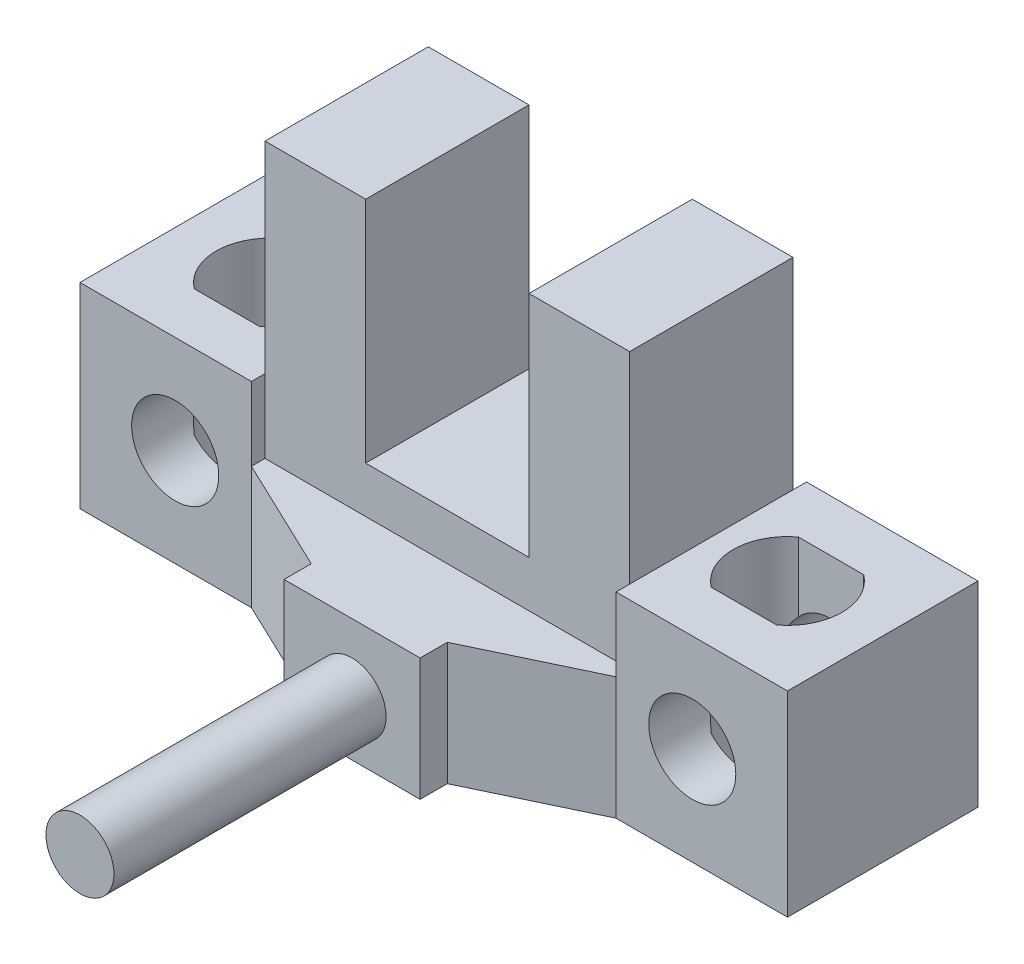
ISO-10303-21;
HEADER;
FILE_DESCRIPTION(('STEP AP214'),'2;1');
FILE_NAME('part.step','',(''),(''),'','','');
FILE_SCHEMA(('AUTOMOTIVE_DESIGN { 1 0 10303 214 1 1 1 1 }'));
ENDSEC;
DATA;
#1=APPLICATION_CONTEXT('core data for automotive mechanical design processes');
#2=APPLICATION_PROTOCOL_DEFINITION('international standard','automotive_design',2000,#1);
#3=PRODUCT_CONTEXT('',#1,'mechanical');
#4=PRODUCT('Part','Part','',(#3));
#5=PRODUCT_RELATED_PRODUCT_CATEGORY('part','',(#4));
#6=PRODUCT_DEFINITION_FORMATION('','',#4);
#7=PRODUCT_DEFINITION_CONTEXT('part definition',#1,'design');
#8=PRODUCT_DEFINITION('design','',#6,#7);
#9=PRODUCT_DEFINITION_SHAPE('','',#8);
#10=(LENGTH_UNIT() NAMED_UNIT(*) SI_UNIT(.MILLI.,.METRE.));
#11=(NAMED_UNIT(*) PLANE_ANGLE_UNIT() SI_UNIT($,.RADIAN.));
#12=(NAMED_UNIT(*) SI_UNIT($,.STERADIAN.) SOLID_ANGLE_UNIT());
#13=UNCERTAINTY_MEASURE_WITH_UNIT(LENGTH_MEASURE(1.E-05),#10,'distance_accuracy_value','');
#14=(GEOMETRIC_REPRESENTATION_CONTEXT(3) GLOBAL_UNCERTAINTY_ASSIGNED_CONTEXT((#13)) GLOBAL_UNIT_ASSIGNED_CONTEXT((#10,
#11,#12)) REPRESENTATION_CONTEXT('',''));
#15=CARTESIAN_POINT('',(0.,0.,0.));
#16=DIRECTION('',(0.,0.,1.));
#17=DIRECTION('',(1.,0.,0.));
#18=AXIS2_PLACEMENT_3D('',#15,#16,#17);
#19=CARTESIAN_POINT('',(22.5,3.6,0.));
#20=DIRECTION('',(0.,0.,1.));
#21=DIRECTION('',(1.,0.,0.));
#22=AXIS2_PLACEMENT_3D('',#19,#20,#21);
#23=CYLINDRICAL_SURFACE('',#22,1.6);
#24=CARTESIAN_POINT('',(22.5,3.6,5.1));
#25=DIRECTION('',(0.,0.,1.));
#26=DIRECTION('',(1.,0.,0.));
#27=AXIS2_PLACEMENT_3D('',#24,#25,#26);
#28=CIRCLE('',#27,1.6);
#29=CARTESIAN_POINT('',(21.3,4.65830052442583,5.1));
#30=VERTEX_POINT('',#29);
#31=CARTESIAN_POINT('',(23.7,4.65830052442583,5.1));
#32=VERTEX_POINT('',#31);
#33=EDGE_CURVE('E642',#30,#32,#28,.F.);
#34=ORIENTED_EDGE('',*,*,#33,.T.);
#35=CARTESIAN_POINT('',(23.7,4.65830052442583,5.1));
#36=CARTESIAN_POINT('',(23.7290422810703,4.62535378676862,5.07822637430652));
#37=CARTESIAN_POINT('',(23.756679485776,4.59129740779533,5.05625519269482));
#38=CARTESIAN_POINT('',(23.809130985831,4.52093078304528,5.01239542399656));
#39=CARTESIAN_POINT('',(23.8339411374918,4.48461734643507,4.9905070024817));
#40=CARTESIAN_POINT('',(23.8810038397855,4.4092168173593,4.94702155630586));
#41=CARTESIAN_POINT('',(23.9032107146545,4.37009542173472,4.92543432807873));
#42=CARTESIAN_POINT('',(23.9444788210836,4.28958410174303,4.88359830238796));
#43=CARTESIAN_POINT('',(23.9635421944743,4.24819574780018,4.86334859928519));
#44=CARTESIAN_POINT('',(24.0043558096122,4.1483967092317,4.81837811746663));
#45=CARTESIAN_POINT('',(24.0247724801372,4.08903023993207,4.79451734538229));
#46=CARTESIAN_POINT('',(24.0587589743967,3.96644275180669,4.75339036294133));
#47=CARTESIAN_POINT('',(24.0723652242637,3.90324431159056,4.73608919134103));
#48=CARTESIAN_POINT('',(24.090262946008,3.78450777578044,4.71294903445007));
#49=CARTESIAN_POINT('',(24.0957238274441,3.72943427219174,4.70568635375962));
#50=CARTESIAN_POINT('',(24.1008531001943,3.61853853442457,4.69887097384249));
#51=CARTESIAN_POINT('',(24.1005243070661,3.56271667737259,4.6993145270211));
#52=CARTESIAN_POINT('',(24.0941173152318,3.45217551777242,4.70781341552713));
#53=CARTESIAN_POINT('',(24.0880543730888,3.39745368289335,4.71584855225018));
#54=CARTESIAN_POINT('',(24.07065613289,3.29015196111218,4.73823945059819));
#55=CARTESIAN_POINT('',(24.0593107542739,3.23757637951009,4.75260729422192));
#56=CARTESIAN_POINT('',(24.0241684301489,3.10623257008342,4.79539084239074));
#57=CARTESIAN_POINT('',(23.9969585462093,3.0294896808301,4.82715431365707));
#58=CARTESIAN_POINT('',(23.9326185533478,2.88304065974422,4.89636878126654));
#59=CARTESIAN_POINT('',(23.895464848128,2.81335181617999,4.9338332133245));
#60=CARTESIAN_POINT('',(23.8307840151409,2.71069568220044,4.99331645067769));
#61=CARTESIAN_POINT('',(23.8064411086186,2.67530755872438,5.01470495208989));
#62=CARTESIAN_POINT('',(23.7551675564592,2.6068391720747,5.05745407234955));
#63=CARTESIAN_POINT('',(23.7282527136,2.57374673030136,5.07881413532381));
#64=CARTESIAN_POINT('',(23.7,2.54169947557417,5.1));
#65=B_SPLINE_CURVE_WITH_KNOTS('',3,(#35,#36,#37,#38,#39,#40,#41,#42,#43,#44,#45,#46,#47,#48,#49,
#50,#51,#52,#53,#54,#55,#56,#57,#58,#59,#60,#61,#62,#63,#64),.UNSPECIFIED.,.F.,.F.,(4,2,2,2,2,2,
2,2,2,2,2,2,2,2,4),(0.,0.147030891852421,0.294274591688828,0.443803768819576,0.593230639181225,
0.794088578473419,0.993860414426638,1.16054956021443,1.32715764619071,1.49332368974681,
1.65980813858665,1.92056010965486,2.18193640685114,2.32577512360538,2.46878082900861),.UNSPECIFIED.);
#66=CARTESIAN_POINT('',(23.7,2.54169947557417,5.1));
#67=VERTEX_POINT('',#66);
#68=EDGE_CURVE('E11',#32,#67,#65,.T.);
#69=ORIENTED_EDGE('',*,*,#68,.T.);
#70=CARTESIAN_POINT('',(21.3,2.54169947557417,5.1));
#71=VERTEX_POINT('',#70);
#72=EDGE_CURVE('E48',#67,#71,#28,.F.);
#73=ORIENTED_EDGE('',*,*,#72,.T.);
#74=CARTESIAN_POINT('',(21.3,2.54169947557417,5.1));
#75=CARTESIAN_POINT('',(21.2709577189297,2.57464621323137,5.07822637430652));
#76=CARTESIAN_POINT('',(21.243320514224,2.60870259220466,5.05625519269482));
#77=CARTESIAN_POINT('',(21.190869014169,2.67906921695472,5.01239542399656));
#78=CARTESIAN_POINT('',(21.1660588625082,2.71538265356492,4.9905070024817));
#79=CARTESIAN_POINT('',(21.1189961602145,2.7907831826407,4.94702155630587));
#80=CARTESIAN_POINT('',(21.0967892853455,2.82990457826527,4.92543432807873));
#81=CARTESIAN_POINT('',(21.0555211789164,2.91041589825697,4.88359830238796));
#82=CARTESIAN_POINT('',(21.0364578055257,2.95180425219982,4.86334859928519));
#83=CARTESIAN_POINT('',(20.9956441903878,3.0516032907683,4.81837811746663));
#84=CARTESIAN_POINT('',(20.9752275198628,3.11096976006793,4.79451734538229));
#85=CARTESIAN_POINT('',(20.9412410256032,3.23355724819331,4.75339036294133));
#86=CARTESIAN_POINT('',(20.9276347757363,3.29675568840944,4.73608919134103));
#87=CARTESIAN_POINT('',(20.909737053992,3.41549222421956,4.71294903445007));
#88=CARTESIAN_POINT('',(20.9042761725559,3.47056572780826,4.70568635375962));
#89=CARTESIAN_POINT('',(20.8991468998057,3.58146146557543,4.69887097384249));
#90=CARTESIAN_POINT('',(20.8994756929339,3.63728332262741,4.6993145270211));
#91=CARTESIAN_POINT('',(20.9058826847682,3.74782448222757,4.70781341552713));
#92=CARTESIAN_POINT('',(20.9119456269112,3.80254631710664,4.71584855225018));
#93=CARTESIAN_POINT('',(20.92934386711,3.90984803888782,4.73823945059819));
#94=CARTESIAN_POINT('',(20.9406892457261,3.96242362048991,4.75260729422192));
#95=CARTESIAN_POINT('',(20.9758315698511,4.09376742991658,4.79539084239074));
#96=CARTESIAN_POINT('',(21.0030414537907,4.17051031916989,4.82715431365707));
#97=CARTESIAN_POINT('',(21.0673814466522,4.31695934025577,4.89636878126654));
#98=CARTESIAN_POINT('',(21.104535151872,4.38664818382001,4.9338332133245));
#99=CARTESIAN_POINT('',(21.1692159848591,4.48930431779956,4.99331645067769));
#100=CARTESIAN_POINT('',(21.1935588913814,4.52469244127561,5.01470495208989));
#101=CARTESIAN_POINT('',(21.2448324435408,4.5931608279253,5.05745407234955));
#102=CARTESIAN_POINT('',(21.2717472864,4.62625326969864,5.07881413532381));
#103=CARTESIAN_POINT('',(21.3,4.65830052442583,5.1));
#104=B_SPLINE_CURVE_WITH_KNOTS('',3,(#74,#75,#76,#77,#78,#79,#80,#81,#82,#83,#84,#85,#86,#87,
#88,#89,#90,#91,#92,#93,#94,#95,#96,#97,#98,#99,#100,#101,#102,#103),.UNSPECIFIED.,.F.,.F.,(4,2,
2,2,2,2,2,2,2,2,2,2,2,2,4),(0.,0.147030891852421,0.294274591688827,0.443803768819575,
0.593230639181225,0.794088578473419,0.993860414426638,1.16054956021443,1.32715764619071,
1.4933236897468,1.65980813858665,1.92056010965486,2.18193640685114,2.32577512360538,
2.46878082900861),.UNSPECIFIED.);
#105=EDGE_CURVE('E637',#71,#30,#104,.T.);
#106=ORIENTED_EDGE('',*,*,#105,.T.);
#107=EDGE_LOOP('',(#34,#69,#73,#106));
#108=FACE_BOUND('',#107,.T.);
#109=CARTESIAN_POINT('',(22.5,3.6,7.));
#110=DIRECTION('',(0.,0.,1.));
#111=DIRECTION('',(1.,0.,0.));
#112=AXIS2_PLACEMENT_3D('',#109,#110,#111);
#113=CIRCLE('',#112,1.6);
#114=CARTESIAN_POINT('',(24.1,3.6,7.));
#115=VERTEX_POINT('',#114);
#116=EDGE_CURVE('E379',#115,#115,#113,.T.);
#117=ORIENTED_EDGE('',*,*,#116,.T.);
#118=EDGE_LOOP('',(#117));
#119=FACE_BOUND('',#118,.T.);
#120=ADVANCED_FACE('F35',(#108,#119),#23,.F.);
#121=CARTESIAN_POINT('',(0.,0.,7.));
#122=DIRECTION('',(0.,1.,0.));
#123=DIRECTION('',(0.,0.,1.));
#124=AXIS2_PLACEMENT_3D('',#121,#122,#123);
#125=PLANE('',#124);
#126=DIRECTION('',(1.,0.,0.));
#127=VECTOR('',#126,1.);
#128=CARTESIAN_POINT('',(23.7,0.,5.1));
#129=LINE('',#128,#127);
#130=CARTESIAN_POINT('',(21.3,0.,5.1));
#131=VERTEX_POINT('',#130);
#132=CARTESIAN_POINT('',(23.7,0.,5.1));
#133=VERTEX_POINT('',#132);
#134=EDGE_CURVE('E314',#131,#133,#129,.T.);
#135=ORIENTED_EDGE('',*,*,#134,.T.);
#136=CARTESIAN_POINT('',(22.5,0.,3.5));
#137=DIRECTION('',(0.,1.,0.));
#138=DIRECTION('',(0.,0.,1.));
#139=AXIS2_PLACEMENT_3D('',#136,#137,#138);
#140=CIRCLE('',#139,2.);
#141=CARTESIAN_POINT('',(23.7,0.,1.9));
#142=VERTEX_POINT('',#141);
#143=EDGE_CURVE('E297',#133,#142,#140,.T.);
#144=ORIENTED_EDGE('',*,*,#143,.T.);
#145=DIRECTION('',(-1.,0.,0.));
#146=VECTOR('',#145,1.);
#147=CARTESIAN_POINT('',(22.5,0.,1.9));
#148=LINE('',#147,#146);
#149=CARTESIAN_POINT('',(21.3,0.,1.9));
#150=VERTEX_POINT('',#149);
#151=EDGE_CURVE('E307',#142,#150,#148,.T.);
#152=ORIENTED_EDGE('',*,*,#151,.T.);
#153=CARTESIAN_POINT('',(22.5,0.,3.5));
#154=DIRECTION('',(0.,1.,0.));
#155=DIRECTION('',(0.,0.,1.));
#156=AXIS2_PLACEMENT_3D('',#153,#154,#155);
#157=CIRCLE('',#156,2.);
#158=EDGE_CURVE('E55',#150,#131,#157,.T.);
#159=ORIENTED_EDGE('',*,*,#158,.T.);
#160=EDGE_LOOP('',(#135,#144,#152,#159));
#161=FACE_BOUND('',#160,.T.);
#162=DIRECTION('',(0.90286051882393,0.,0.429933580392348));
#163=VECTOR('',#162,1.);
#164=CARTESIAN_POINT('',(6.3,0.,7.));
#165=LINE('',#164,#163);
#166=CARTESIAN_POINT('',(6.3,0.,7.));
#167=VERTEX_POINT('',#166);
#168=CARTESIAN_POINT('',(10.5,0.,9.));
#169=VERTEX_POINT('',#168);
#170=EDGE_CURVE('E422',#167,#169,#165,.T.);
#171=ORIENTED_EDGE('',*,*,#170,.F.);
#172=DIRECTION('',(1.,0.,0.));
#173=VECTOR('',#172,1.);
#174=CARTESIAN_POINT('',(0.,0.,7.));
#175=LINE('',#174,#173);
#176=CARTESIAN_POINT('',(0.,0.,7.));
#177=VERTEX_POINT('',#176);
#178=EDGE_CURVE('E494',#177,#167,#175,.T.);
#179=ORIENTED_EDGE('',*,*,#178,.F.);
#180=DIRECTION('',(0.,0.,-1.));
#181=VECTOR('',#180,1.);
#182=CARTESIAN_POINT('',(0.,0.,7.));
#183=LINE('',#182,#181);
#184=CARTESIAN_POINT('',(0.,0.,0.));
#185=VERTEX_POINT('',#184);
#186=EDGE_CURVE('E506',#177,#185,#183,.T.);
#187=ORIENTED_EDGE('',*,*,#186,.T.);
#188=DIRECTION('',(1.,0.,0.));
#189=VECTOR('',#188,1.);
#190=CARTESIAN_POINT('',(0.,0.,0.));
#191=LINE('',#190,#189);
#192=CARTESIAN_POINT('',(6.3,0.,0.));
#193=VERTEX_POINT('',#192);
#194=EDGE_CURVE('E507',#185,#193,#191,.T.);
#195=ORIENTED_EDGE('',*,*,#194,.T.);
#196=DIRECTION('',(0.,0.,-1.));
#197=VECTOR('',#196,1.);
#198=CARTESIAN_POINT('',(6.3,0.,0.5));
#199=LINE('',#198,#197);
#200=CARTESIAN_POINT('',(6.3,0.,0.5));
#201=VERTEX_POINT('',#200);
#202=EDGE_CURVE('E461',#201,#193,#199,.T.);
#203=ORIENTED_EDGE('',*,*,#202,.F.);
#204=DIRECTION('',(1.,0.,0.));
#205=VECTOR('',#204,1.);
#206=CARTESIAN_POINT('',(6.3,0.,0.5));
#207=LINE('',#206,#205);
#208=CARTESIAN_POINT('',(19.7,0.,0.5));
#209=VERTEX_POINT('',#208);
#210=EDGE_CURVE('E435',#201,#209,#207,.T.);
#211=ORIENTED_EDGE('',*,*,#210,.T.);
#212=DIRECTION('',(0.,0.,-1.));
#213=VECTOR('',#212,1.);
#214=CARTESIAN_POINT('',(19.7,0.,0.5));
#215=LINE('',#214,#213);
#216=CARTESIAN_POINT('',(19.7,0.,0.));
#217=VERTEX_POINT('',#216);
#218=EDGE_CURVE('E465',#209,#217,#215,.T.);
#219=ORIENTED_EDGE('',*,*,#218,.T.);
#220=CARTESIAN_POINT('',(26.,0.,0.));
#221=VERTEX_POINT('',#220);
#222=EDGE_CURVE('E490',#217,#221,#191,.T.);
#223=ORIENTED_EDGE('',*,*,#222,.T.);
#224=DIRECTION('',(0.,0.,-1.));
#225=VECTOR('',#224,1.);
#226=CARTESIAN_POINT('',(26.,0.,7.));
#227=LINE('',#226,#225);
#228=CARTESIAN_POINT('',(26.,0.,7.));
#229=VERTEX_POINT('',#228);
#230=EDGE_CURVE('E553',#229,#221,#227,.T.);
#231=ORIENTED_EDGE('',*,*,#230,.F.);
#232=CARTESIAN_POINT('',(19.7,0.,7.));
#233=VERTEX_POINT('',#232);
#234=EDGE_CURVE('E497',#233,#229,#175,.T.);
#235=ORIENTED_EDGE('',*,*,#234,.F.);
#236=DIRECTION('',(-0.90286051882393,0.,0.429933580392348));
#237=VECTOR('',#236,1.);
#238=CARTESIAN_POINT('',(19.7,0.,7.));
#239=LINE('',#238,#237);
#240=CARTESIAN_POINT('',(15.5,0.,9.));
#241=VERTEX_POINT('',#240);
#242=EDGE_CURVE('E396',#233,#241,#239,.T.);
#243=ORIENTED_EDGE('',*,*,#242,.T.);
#244=DIRECTION('',(0.,0.,1.));
#245=VECTOR('',#244,1.);
#246=CARTESIAN_POINT('',(15.5,0.,9.));
#247=LINE('',#246,#245);
#248=CARTESIAN_POINT('',(15.5,0.,10.));
#249=VERTEX_POINT('',#248);
#250=EDGE_CURVE('E389',#241,#249,#247,.T.);
#251=ORIENTED_EDGE('',*,*,#250,.T.);
#252=DIRECTION('',(-1.,0.,0.));
#253=VECTOR('',#252,1.);
#254=CARTESIAN_POINT('',(15.5,0.,10.));
#255=LINE('',#254,#253);
#256=CARTESIAN_POINT('',(10.5,0.,10.));
#257=VERTEX_POINT('',#256);
#258=EDGE_CURVE('E416',#249,#257,#255,.T.);
#259=ORIENTED_EDGE('',*,*,#258,.T.);
#260=DIRECTION('',(0.,0.,-1.));
#261=VECTOR('',#260,1.);
#262=CARTESIAN_POINT('',(10.5,0.,10.));
#263=LINE('',#262,#261);
#264=EDGE_CURVE('E419',#257,#169,#263,.T.);
#265=ORIENTED_EDGE('',*,*,#264,.T.);
#266=EDGE_LOOP('',(#171,#179,#187,#195,#203,#211,#219,#223,#231,#235,#243,#251,#259,#265));
#267=FACE_BOUND('',#266,.T.);
#268=DIRECTION('',(1.,0.,0.));
#269=VECTOR('',#268,1.);
#270=CARTESIAN_POINT('',(2.3,0.,1.9));
#271=LINE('',#270,#269);
#272=CARTESIAN_POINT('',(2.3,0.,1.9));
#273=VERTEX_POINT('',#272);
#274=CARTESIAN_POINT('',(4.7,0.,1.9));
#275=VERTEX_POINT('',#274);
#276=EDGE_CURVE('E342',#273,#275,#271,.T.);
#277=ORIENTED_EDGE('',*,*,#276,.F.);
#278=CARTESIAN_POINT('',(3.5,0.,3.5));
#279=DIRECTION('',(0.,1.,0.));
#280=DIRECTION('',(0.,0.,1.));
#281=AXIS2_PLACEMENT_3D('',#278,#279,#280);
#282=CIRCLE('',#281,2.);
#283=CARTESIAN_POINT('',(2.3,0.,5.1));
#284=VERTEX_POINT('',#283);
#285=EDGE_CURVE('E351',#273,#284,#282,.T.);
#286=ORIENTED_EDGE('',*,*,#285,.T.);
#287=DIRECTION('',(-1.,0.,0.));
#288=VECTOR('',#287,1.);
#289=CARTESIAN_POINT('',(4.7,0.,5.1));
#290=LINE('',#289,#288);
#291=CARTESIAN_POINT('',(4.7,0.,5.1));
#292=VERTEX_POINT('',#291);
#293=EDGE_CURVE('E348',#292,#284,#290,.T.);
#294=ORIENTED_EDGE('',*,*,#293,.F.);
#295=CARTESIAN_POINT('',(3.5,0.,3.5));
#296=DIRECTION('',(0.,1.,0.));
#297=DIRECTION('',(0.,0.,1.));
#298=AXIS2_PLACEMENT_3D('',#295,#296,#297);
#299=CIRCLE('',#298,2.);
#300=EDGE_CURVE('E344',#292,#275,#299,.T.);
#301=ORIENTED_EDGE('',*,*,#300,.T.);
#302=EDGE_LOOP('',(#277,#286,#294,#301));
#303=FACE_BOUND('',#302,.T.);
#304=ADVANCED_FACE('F37',(#161,#267,#303),#125,.F.);
#305=CARTESIAN_POINT('',(0.,7.2,7.));
#306=DIRECTION('',(0.,-1.,0.));
#307=DIRECTION('',(0.,0.,-1.));
#308=AXIS2_PLACEMENT_3D('',#305,#306,#307);
#309=PLANE('',#308);
#310=DIRECTION('',(-1.,0.,0.));
#311=VECTOR('',#310,1.);
#312=CARTESIAN_POINT('',(0.,7.2,0.));
#313=LINE('',#312,#311);
#314=CARTESIAN_POINT('',(6.3,7.2,0.));
#315=VERTEX_POINT('',#314);
#316=CARTESIAN_POINT('',(0.,7.2,0.));
#317=VERTEX_POINT('',#316);
#318=EDGE_CURVE('E515',#315,#317,#313,.T.);
#319=ORIENTED_EDGE('',*,*,#318,.T.);
#320=DIRECTION('',(0.,0.,-1.));
#321=VECTOR('',#320,1.);
#322=CARTESIAN_POINT('',(0.,7.2,7.));
#323=LINE('',#322,#321);
#324=CARTESIAN_POINT('',(0.,7.2,7.));
#325=VERTEX_POINT('',#324);
#326=EDGE_CURVE('E521',#325,#317,#323,.T.);
#327=ORIENTED_EDGE('',*,*,#326,.F.);
#328=DIRECTION('',(-1.,0.,0.));
#329=VECTOR('',#328,1.);
#330=CARTESIAN_POINT('',(0.,7.2,7.));
#331=LINE('',#330,#329);
#332=CARTESIAN_POINT('',(6.3,7.2,7.));
#333=VERTEX_POINT('',#332);
#334=EDGE_CURVE('E502',#333,#325,#331,.T.);
#335=ORIENTED_EDGE('',*,*,#334,.F.);
#336=DIRECTION('',(0.,0.,-1.));
#337=VECTOR('',#336,1.);
#338=CARTESIAN_POINT('',(6.3,7.2,7.));
#339=LINE('',#338,#337);
#340=CARTESIAN_POINT('',(6.3,7.2,6.5));
#341=VERTEX_POINT('',#340);
#342=EDGE_CURVE('E525',#333,#341,#339,.T.);
#343=ORIENTED_EDGE('',*,*,#342,.T.);
#344=CARTESIAN_POINT('',(6.3,7.2,0.5));
#345=VERTEX_POINT('',#344);
#346=EDGE_CURVE('E524',#341,#345,#339,.T.);
#347=ORIENTED_EDGE('',*,*,#346,.T.);
#348=DIRECTION('',(0.,0.,1.));
#349=VECTOR('',#348,1.);
#350=CARTESIAN_POINT('',(6.3,7.2,7.));
#351=LINE('',#350,#349);
#352=EDGE_CURVE('E468',#315,#345,#351,.T.);
#353=ORIENTED_EDGE('',*,*,#352,.F.);
#354=EDGE_LOOP('',(#319,#327,#335,#343,#347,#353));
#355=FACE_BOUND('',#354,.T.);
#356=DIRECTION('',(1.,0.,0.));
#357=VECTOR('',#356,1.);
#358=CARTESIAN_POINT('',(3.5,7.2,1.9));
#359=LINE('',#358,#357);
#360=CARTESIAN_POINT('',(2.3,7.2,1.9));
#361=VERTEX_POINT('',#360);
#362=CARTESIAN_POINT('',(4.7,7.2,1.9));
#363=VERTEX_POINT('',#362);
#364=EDGE_CURVE('E335',#361,#363,#359,.T.);
#365=ORIENTED_EDGE('',*,*,#364,.T.);
#366=CARTESIAN_POINT('',(3.5,7.2,3.5));
#367=DIRECTION('',(0.,1.,0.));
#368=DIRECTION('',(0.,0.,1.));
#369=AXIS2_PLACEMENT_3D('',#366,#367,#368);
#370=CIRCLE('',#369,2.);
#371=CARTESIAN_POINT('',(4.7,7.2,5.1));
#372=VERTEX_POINT('',#371);
#373=EDGE_CURVE('E357',#372,#363,#370,.T.);
#374=ORIENTED_EDGE('',*,*,#373,.F.);
#375=DIRECTION('',(-1.,0.,0.));
#376=VECTOR('',#375,1.);
#377=CARTESIAN_POINT('',(4.7,7.2,5.1));
#378=LINE('',#377,#376);
#379=CARTESIAN_POINT('',(2.3,7.2,5.1));
#380=VERTEX_POINT('',#379);
#381=EDGE_CURVE('E360',#372,#380,#378,.T.);
#382=ORIENTED_EDGE('',*,*,#381,.T.);
#383=CARTESIAN_POINT('',(3.5,7.2,3.5));
#384=DIRECTION('',(0.,1.,0.));
#385=DIRECTION('',(0.,0.,1.));
#386=AXIS2_PLACEMENT_3D('',#383,#384,#385);
#387=CIRCLE('',#386,2.);
#388=EDGE_CURVE('E345',#361,#380,#387,.T.);
#389=ORIENTED_EDGE('',*,*,#388,.F.);
#390=EDGE_LOOP('',(#365,#374,#382,#389));
#391=FACE_BOUND('',#390,.T.);
#392=ADVANCED_FACE('F664',(#355,#391),#309,.F.);
#393=CARTESIAN_POINT('',(3.5,3.6,0.));
#394=DIRECTION('',(0.,0.,1.));
#395=DIRECTION('',(1.,0.,0.));
#396=AXIS2_PLACEMENT_3D('',#393,#394,#395);
#397=CYLINDRICAL_SURFACE('',#396,1.6);
#398=CARTESIAN_POINT('',(3.5,3.6,5.1));
#399=DIRECTION('',(0.,0.,-1.));
#400=DIRECTION('',(-1.,0.,0.));
#401=AXIS2_PLACEMENT_3D('',#398,#399,#400);
#402=CIRCLE('',#401,1.6);
#403=CARTESIAN_POINT('',(4.7,4.65830052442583,5.1));
#404=VERTEX_POINT('',#403);
#405=CARTESIAN_POINT('',(2.3,4.65830052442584,5.1));
#406=VERTEX_POINT('',#405);
#407=EDGE_CURVE('E594',#404,#406,#402,.F.);
#408=ORIENTED_EDGE('',*,*,#407,.F.);
#409=CARTESIAN_POINT('',(4.7,4.65830052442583,5.1));
#410=CARTESIAN_POINT('',(4.72904228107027,4.62535378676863,5.07822637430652));
#411=CARTESIAN_POINT('',(4.75667948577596,4.59129740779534,5.05625519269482));
#412=CARTESIAN_POINT('',(4.80913098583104,4.52093078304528,5.01239542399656));
#413=CARTESIAN_POINT('',(4.83394113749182,4.48461734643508,4.9905070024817));
#414=CARTESIAN_POINT('',(4.88100383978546,4.4092168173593,4.94702155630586));
#415=CARTESIAN_POINT('',(4.9032107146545,4.37009542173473,4.92543432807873));
#416=CARTESIAN_POINT('',(4.94447882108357,4.28958410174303,4.88359830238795));
#417=CARTESIAN_POINT('',(4.96354219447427,4.24819574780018,4.86334859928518));
#418=CARTESIAN_POINT('',(5.00435580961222,4.1483967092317,4.81837811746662));
#419=CARTESIAN_POINT('',(5.02477248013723,4.08903023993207,4.79451734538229));
#420=CARTESIAN_POINT('',(5.05875897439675,3.96644275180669,4.75339036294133));
#421=CARTESIAN_POINT('',(5.07236522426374,3.90324431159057,4.73608919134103));
#422=CARTESIAN_POINT('',(5.09026294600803,3.78450777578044,4.71294903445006));
#423=CARTESIAN_POINT('',(5.09572382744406,3.72943427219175,4.70568635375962));
#424=CARTESIAN_POINT('',(5.10085310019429,3.61853853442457,4.69887097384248));
#425=CARTESIAN_POINT('',(5.10052430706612,3.56271667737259,4.6993145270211));
#426=CARTESIAN_POINT('',(5.09411731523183,3.45217551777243,4.70781341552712));
#427=CARTESIAN_POINT('',(5.08805437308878,3.39745368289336,4.71584855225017));
#428=CARTESIAN_POINT('',(5.07065613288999,3.29015196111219,4.73823945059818));
#429=CARTESIAN_POINT('',(5.05931075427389,3.2375763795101,4.75260729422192));
#430=CARTESIAN_POINT('',(5.0241684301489,3.10623257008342,4.79539084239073));
#431=CARTESIAN_POINT('',(4.99695854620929,3.02948968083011,4.82715431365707));
#432=CARTESIAN_POINT('',(4.93261855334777,2.88304065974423,4.89636878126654));
#433=CARTESIAN_POINT('',(4.89546484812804,2.81335181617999,4.9338332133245));
#434=CARTESIAN_POINT('',(4.83078401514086,2.71069568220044,4.99331645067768));
#435=CARTESIAN_POINT('',(4.8064411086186,2.67530755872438,5.01470495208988));
#436=CARTESIAN_POINT('',(4.75516755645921,2.6068391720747,5.05745407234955));
#437=CARTESIAN_POINT('',(4.72825271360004,2.57374673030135,5.07881413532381));
#438=CARTESIAN_POINT('',(4.7,2.54169947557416,5.1));
#439=B_SPLINE_CURVE_WITH_KNOTS('',3,(#409,#410,#411,#412,#413,#414,#415,#416,#417,#418,#419,
#420,#421,#422,#423,#424,#425,#426,#427,#428,#429,#430,#431,#432,#433,#434,#435,#436,#437,#438),
.UNSPECIFIED.,.F.,.F.,(4,2,2,2,2,2,2,2,2,2,2,2,2,2,4),(0.,0.147030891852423,0.294274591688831,
0.443803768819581,0.593230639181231,0.794088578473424,0.993860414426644,1.16054956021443,
1.32715764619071,1.49332368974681,1.65980813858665,1.92056010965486,2.18193640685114,
2.32577512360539,2.46878082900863),.UNSPECIFIED.);
#440=CARTESIAN_POINT('',(4.7,2.54169947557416,5.1));
#441=VERTEX_POINT('',#440);
#442=EDGE_CURVE('E602',#404,#441,#439,.T.);
#443=ORIENTED_EDGE('',*,*,#442,.T.);
#444=CARTESIAN_POINT('',(2.3,2.54169947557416,5.1));
#445=VERTEX_POINT('',#444);
#446=EDGE_CURVE('E601',#445,#441,#402,.F.);
#447=ORIENTED_EDGE('',*,*,#446,.F.);
#448=CARTESIAN_POINT('',(2.3,2.54169947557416,5.1));
#449=CARTESIAN_POINT('',(2.27095771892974,2.57464621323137,5.07822637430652));
#450=CARTESIAN_POINT('',(2.24332051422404,2.60870259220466,5.05625519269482));
#451=CARTESIAN_POINT('',(2.19086901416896,2.67906921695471,5.01239542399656));
#452=CARTESIAN_POINT('',(2.16605886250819,2.71538265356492,4.9905070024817));
#453=CARTESIAN_POINT('',(2.11899616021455,2.79078318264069,4.94702155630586));
#454=CARTESIAN_POINT('',(2.09678928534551,2.82990457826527,4.92543432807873));
#455=CARTESIAN_POINT('',(2.05552117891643,2.91041589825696,4.88359830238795));
#456=CARTESIAN_POINT('',(2.03645780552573,2.95180425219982,4.86334859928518));
#457=CARTESIAN_POINT('',(1.99564419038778,3.0516032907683,4.81837811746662));
#458=CARTESIAN_POINT('',(1.97522751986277,3.11096976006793,4.79451734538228));
#459=CARTESIAN_POINT('',(1.94124102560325,3.23355724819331,4.75339036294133));
#460=CARTESIAN_POINT('',(1.92763477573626,3.29675568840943,4.73608919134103));
#461=CARTESIAN_POINT('',(1.90973705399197,3.41549222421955,4.71294903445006));
#462=CARTESIAN_POINT('',(1.90427617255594,3.47056572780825,4.70568635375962));
#463=CARTESIAN_POINT('',(1.89914689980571,3.58146146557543,4.69887097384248));
#464=CARTESIAN_POINT('',(1.89947569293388,3.6372833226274,4.6993145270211));
#465=CARTESIAN_POINT('',(1.90588268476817,3.74782448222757,4.70781341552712));
#466=CARTESIAN_POINT('',(1.91194562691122,3.80254631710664,4.71584855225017));
#467=CARTESIAN_POINT('',(1.92934386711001,3.90984803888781,4.73823945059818));
#468=CARTESIAN_POINT('',(1.94068924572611,3.9624236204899,4.75260729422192));
#469=CARTESIAN_POINT('',(1.97583156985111,4.09376742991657,4.79539084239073));
#470=CARTESIAN_POINT('',(2.00304145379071,4.17051031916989,4.82715431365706));
#471=CARTESIAN_POINT('',(2.06738144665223,4.31695934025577,4.89636878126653));
#472=CARTESIAN_POINT('',(2.10453515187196,4.38664818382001,4.9338332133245));
#473=CARTESIAN_POINT('',(2.16921598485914,4.48930431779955,4.99331645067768));
#474=CARTESIAN_POINT('',(2.1935588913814,4.52469244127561,5.01470495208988));
#475=CARTESIAN_POINT('',(2.2448324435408,4.5931608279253,5.05745407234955));
#476=CARTESIAN_POINT('',(2.27174728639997,4.62625326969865,5.07881413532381));
#477=CARTESIAN_POINT('',(2.3,4.65830052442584,5.1));
#478=B_SPLINE_CURVE_WITH_KNOTS('',3,(#448,#449,#450,#451,#452,#453,#454,#455,#456,#457,#458,
#459,#460,#461,#462,#463,#464,#465,#466,#467,#468,#469,#470,#471,#472,#473,#474,#475,#476,#477),
.UNSPECIFIED.,.F.,.F.,(4,2,2,2,2,2,2,2,2,2,2,2,2,2,4),(0.,0.147030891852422,0.294274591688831,
0.443803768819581,0.593230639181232,0.794088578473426,0.993860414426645,1.16054956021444,
1.32715764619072,1.49332368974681,1.65980813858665,1.92056010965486,2.18193640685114,
2.32577512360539,2.46878082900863),.UNSPECIFIED.);
#479=EDGE_CURVE('E588',#445,#406,#478,.T.);
#480=ORIENTED_EDGE('',*,*,#479,.T.);
#481=EDGE_LOOP('',(#408,#443,#447,#480));
#482=FACE_BOUND('',#481,.T.);
#483=CARTESIAN_POINT('',(3.5,3.6,7.));
#484=DIRECTION('',(0.,0.,1.));
#485=DIRECTION('',(1.,0.,0.));
#486=AXIS2_PLACEMENT_3D('',#483,#484,#485);
#487=CIRCLE('',#486,1.6);
#488=CARTESIAN_POINT('',(5.1,3.6,7.));
#489=VERTEX_POINT('',#488);
#490=EDGE_CURVE('E383',#489,#489,#487,.T.);
#491=ORIENTED_EDGE('',*,*,#490,.T.);
#492=EDGE_LOOP('',(#491));
#493=FACE_BOUND('',#492,.T.);
#494=ADVANCED_FACE('F809',(#482,#493),#397,.F.);
#495=CARTESIAN_POINT('',(6.3,7.2,6.5));
#496=DIRECTION('',(-1.,0.,0.));
#497=DIRECTION('',(0.,0.,1.));
#498=AXIS2_PLACEMENT_3D('',#495,#496,#497);
#499=PLANE('',#498);
#500=DIRECTION('',(0.,0.,-1.));
#501=VECTOR('',#500,1.);
#502=CARTESIAN_POINT('',(6.3,4.5,7.));
#503=LINE('',#502,#501);
#504=CARTESIAN_POINT('',(6.3,4.5,7.));
#505=VERTEX_POINT('',#504);
#506=CARTESIAN_POINT('',(6.3,4.5,6.5));
#507=VERTEX_POINT('',#506);
#508=EDGE_CURVE('E404',#505,#507,#503,.T.);
#509=ORIENTED_EDGE('',*,*,#508,.T.);
#510=DIRECTION('',(0.,-1.,0.));
#511=VECTOR('',#510,1.);
#512=CARTESIAN_POINT('',(6.3,0.,6.5));
#513=LINE('',#512,#511);
#514=EDGE_CURVE('E477',#341,#507,#513,.T.);
#515=ORIENTED_EDGE('',*,*,#514,.F.);
#516=ORIENTED_EDGE('',*,*,#342,.F.);
#517=DIRECTION('',(0.,1.,0.));
#518=VECTOR('',#517,1.);
#519=CARTESIAN_POINT('',(6.3,0.,7.));
#520=LINE('',#519,#518);
#521=EDGE_CURVE('E556',#505,#333,#520,.T.);
#522=ORIENTED_EDGE('',*,*,#521,.F.);
#523=EDGE_LOOP('',(#509,#515,#516,#522));
#524=FACE_BOUND('',#523,.T.);
#525=ADVANCED_FACE('F806',(#524),#499,.F.);
#526=CARTESIAN_POINT('',(19.7,14.6,6.5));
#527=DIRECTION('',(1.,0.,0.));
#528=DIRECTION('',(0.,0.,-1.));
#529=AXIS2_PLACEMENT_3D('',#526,#527,#528);
#530=PLANE('',#529);
#531=DIRECTION('',(0.,0.,1.));
#532=VECTOR('',#531,1.);
#533=CARTESIAN_POINT('',(19.7,4.5,6.5));
#534=LINE('',#533,#532);
#535=CARTESIAN_POINT('',(19.7,4.5,6.5));
#536=VERTEX_POINT('',#535);
#537=CARTESIAN_POINT('',(19.7,4.5,7.));
#538=VERTEX_POINT('',#537);
#539=EDGE_CURVE('E408',#536,#538,#534,.T.);
#540=ORIENTED_EDGE('',*,*,#539,.T.);
#541=DIRECTION('',(0.,1.,0.));
#542=VECTOR('',#541,1.);
#543=CARTESIAN_POINT('',(19.7,14.6,7.));
#544=LINE('',#543,#542);
#545=CARTESIAN_POINT('',(19.7,7.2,7.));
#546=VERTEX_POINT('',#545);
#547=EDGE_CURVE('E472',#538,#546,#544,.T.);
#548=ORIENTED_EDGE('',*,*,#547,.T.);
#549=DIRECTION('',(0.,0.,-1.));
#550=VECTOR('',#549,1.);
#551=CARTESIAN_POINT('',(19.7,7.2,7.));
#552=LINE('',#551,#550);
#553=CARTESIAN_POINT('',(19.7,7.2,6.5));
#554=VERTEX_POINT('',#553);
#555=EDGE_CURVE('E547',#546,#554,#552,.T.);
#556=ORIENTED_EDGE('',*,*,#555,.T.);
#557=DIRECTION('',(0.,1.,0.));
#558=VECTOR('',#557,1.);
#559=CARTESIAN_POINT('',(19.7,14.6,6.5));
#560=LINE('',#559,#558);
#561=EDGE_CURVE('E478',#536,#554,#560,.T.);
#562=ORIENTED_EDGE('',*,*,#561,.F.);
#563=EDGE_LOOP('',(#540,#548,#556,#562));
#564=FACE_BOUND('',#563,.T.);
#565=ADVANCED_FACE('F690',(#564),#530,.F.);
#566=CARTESIAN_POINT('',(0.,0.,6.5));
#567=DIRECTION('',(0.,0.,-1.));
#568=DIRECTION('',(-1.,0.,0.));
#569=AXIS2_PLACEMENT_3D('',#566,#567,#568);
#570=PLANE('',#569);
#571=DIRECTION('',(1.,0.,0.));
#572=VECTOR('',#571,1.);
#573=CARTESIAN_POINT('',(6.3,4.5,6.5));
#574=LINE('',#573,#572);
#575=EDGE_CURVE('E406',#507,#536,#574,.T.);
#576=ORIENTED_EDGE('',*,*,#575,.T.);
#577=ORIENTED_EDGE('',*,*,#561,.T.);
#578=CARTESIAN_POINT('',(19.7,14.6,6.5));
#579=VERTEX_POINT('',#578);
#580=EDGE_CURVE('E476',#554,#579,#560,.T.);
#581=ORIENTED_EDGE('',*,*,#580,.T.);
#582=DIRECTION('',(-1.,0.,0.));
#583=VECTOR('',#582,1.);
#584=CARTESIAN_POINT('',(16.,14.6,6.5));
#585=LINE('',#584,#583);
#586=CARTESIAN_POINT('',(16.,14.6,6.5));
#587=VERTEX_POINT('',#586);
#588=EDGE_CURVE('E480',#579,#587,#585,.T.);
#589=ORIENTED_EDGE('',*,*,#588,.T.);
#590=DIRECTION('',(0.,-1.,0.));
#591=VECTOR('',#590,1.);
#592=CARTESIAN_POINT('',(16.,6.2,6.5));
#593=LINE('',#592,#591);
#594=CARTESIAN_POINT('',(16.,6.2,6.5));
#595=VERTEX_POINT('',#594);
#596=EDGE_CURVE('E482',#587,#595,#593,.T.);
#597=ORIENTED_EDGE('',*,*,#596,.T.);
#598=DIRECTION('',(-1.,0.,0.));
#599=VECTOR('',#598,1.);
#600=CARTESIAN_POINT('',(10.,6.2,6.5));
#601=LINE('',#600,#599);
#602=CARTESIAN_POINT('',(10.,6.2,6.5));
#603=VERTEX_POINT('',#602);
#604=EDGE_CURVE('E484',#595,#603,#601,.T.);
#605=ORIENTED_EDGE('',*,*,#604,.T.);
#606=DIRECTION('',(0.,1.,0.));
#607=VECTOR('',#606,1.);
#608=CARTESIAN_POINT('',(10.,14.6,6.5));
#609=LINE('',#608,#607);
#610=CARTESIAN_POINT('',(10.,14.6,6.5));
#611=VERTEX_POINT('',#610);
#612=EDGE_CURVE('E486',#603,#611,#609,.T.);
#613=ORIENTED_EDGE('',*,*,#612,.T.);
#614=DIRECTION('',(-1.,0.,0.));
#615=VECTOR('',#614,1.);
#616=CARTESIAN_POINT('',(6.3,14.6,6.5));
#617=LINE('',#616,#615);
#618=CARTESIAN_POINT('',(6.3,14.6,6.5));
#619=VERTEX_POINT('',#618);
#620=EDGE_CURVE('E488',#611,#619,#617,.T.);
#621=ORIENTED_EDGE('',*,*,#620,.T.);
#622=EDGE_CURVE('E473',#619,#341,#513,.T.);
#623=ORIENTED_EDGE('',*,*,#622,.T.);
#624=ORIENTED_EDGE('',*,*,#514,.T.);
#625=EDGE_LOOP('',(#576,#577,#581,#589,#597,#605,#613,#621,#623,#624));
#626=FACE_BOUND('',#625,.T.);
#627=ADVANCED_FACE('F698',(#626),#570,.F.);
#628=CARTESIAN_POINT('',(0.,0.,0.));
#629=DIRECTION('',(0.,0.,-1.));
#630=DIRECTION('',(-1.,0.,0.));
#631=AXIS2_PLACEMENT_3D('',#628,#629,#630);
#632=PLANE('',#631);
#633=CARTESIAN_POINT('',(22.5,3.6,0.));
#634=DIRECTION('',(0.,0.,1.));
#635=DIRECTION('',(1.,0.,0.));
#636=AXIS2_PLACEMENT_3D('',#633,#634,#635);
#637=CIRCLE('',#636,1.6);
#638=CARTESIAN_POINT('',(24.1,3.6,0.));
#639=VERTEX_POINT('',#638);
#640=EDGE_CURVE('E380',#639,#639,#637,.T.);
#641=ORIENTED_EDGE('',*,*,#640,.T.);
#642=EDGE_LOOP('',(#641));
#643=FACE_BOUND('',#642,.T.);
#644=ORIENTED_EDGE('',*,*,#222,.F.);
#645=DIRECTION('',(0.,1.,0.));
#646=VECTOR('',#645,1.);
#647=CARTESIAN_POINT('',(19.7,7.2,0.));
#648=LINE('',#647,#646);
#649=CARTESIAN_POINT('',(19.7,7.2,0.));
#650=VERTEX_POINT('',#649);
#651=EDGE_CURVE('E429',#217,#650,#648,.T.);
#652=ORIENTED_EDGE('',*,*,#651,.T.);
#653=DIRECTION('',(-1.,0.,0.));
#654=VECTOR('',#653,1.);
#655=CARTESIAN_POINT('',(19.7,7.2,0.));
#656=LINE('',#655,#654);
#657=CARTESIAN_POINT('',(26.,7.2,0.));
#658=VERTEX_POINT('',#657);
#659=EDGE_CURVE('E512',#658,#650,#656,.T.);
#660=ORIENTED_EDGE('',*,*,#659,.F.);
#661=DIRECTION('',(0.,1.,0.));
#662=VECTOR('',#661,1.);
#663=CARTESIAN_POINT('',(26.,7.2,0.));
#664=LINE('',#663,#662);
#665=EDGE_CURVE('E510',#221,#658,#664,.T.);
#666=ORIENTED_EDGE('',*,*,#665,.F.);
#667=EDGE_LOOP('',(#644,#652,#660,#666));
#668=FACE_BOUND('',#667,.T.);
#669=ADVANCED_FACE('F747',(#643,#668),#632,.T.);
#670=CARTESIAN_POINT('',(3.5,3.6,0.));
#671=DIRECTION('',(0.,0.,1.));
#672=DIRECTION('',(1.,0.,0.));
#673=AXIS2_PLACEMENT_3D('',#670,#671,#672);
#674=CIRCLE('',#673,1.6);
#675=CARTESIAN_POINT('',(5.1,3.6,0.));
#676=VERTEX_POINT('',#675);
#677=EDGE_CURVE('E386',#676,#676,#674,.T.);
#678=ORIENTED_EDGE('',*,*,#677,.T.);
#679=EDGE_LOOP('',(#678));
#680=FACE_BOUND('',#679,.T.);
#681=ORIENTED_EDGE('',*,*,#318,.F.);
#682=DIRECTION('',(0.,-1.,0.));
#683=VECTOR('',#682,1.);
#684=CARTESIAN_POINT('',(6.3,0.,0.));
#685=LINE('',#684,#683);
#686=EDGE_CURVE('E560',#315,#193,#685,.T.);
#687=ORIENTED_EDGE('',*,*,#686,.T.);
#688=ORIENTED_EDGE('',*,*,#194,.F.);
#689=DIRECTION('',(0.,-1.,0.));
#690=VECTOR('',#689,1.);
#691=CARTESIAN_POINT('',(0.,0.,0.));
#692=LINE('',#691,#690);
#693=EDGE_CURVE('E517',#317,#185,#692,.T.);
#694=ORIENTED_EDGE('',*,*,#693,.F.);
#695=EDGE_LOOP('',(#681,#687,#688,#694));
#696=FACE_BOUND('',#695,.T.);
#697=ADVANCED_FACE('F764',(#680,#696),#632,.T.);
#698=CARTESIAN_POINT('',(0.,0.,7.));
#699=DIRECTION('',(0.,0.,-1.));
#700=DIRECTION('',(-1.,0.,0.));
#701=AXIS2_PLACEMENT_3D('',#698,#699,#700);
#702=PLANE('',#701);
#703=ORIENTED_EDGE('',*,*,#490,.F.);
#704=EDGE_LOOP('',(#703));
#705=FACE_BOUND('',#704,.T.);
#706=ORIENTED_EDGE('',*,*,#178,.T.);
#707=EDGE_CURVE('E557',#167,#505,#520,.T.);
#708=ORIENTED_EDGE('',*,*,#707,.T.);
#709=ORIENTED_EDGE('',*,*,#521,.T.);
#710=ORIENTED_EDGE('',*,*,#334,.T.);
#711=DIRECTION('',(0.,-1.,0.));
#712=VECTOR('',#711,1.);
#713=CARTESIAN_POINT('',(0.,0.,7.));
#714=LINE('',#713,#712);
#715=EDGE_CURVE('E504',#325,#177,#714,.T.);
#716=ORIENTED_EDGE('',*,*,#715,.T.);
#717=EDGE_LOOP('',(#706,#708,#709,#710,#716));
#718=FACE_BOUND('',#717,.T.);
#719=ADVANCED_FACE('F676',(#705,#718),#702,.F.);
#720=CARTESIAN_POINT('',(26.,7.2,7.));
#721=DIRECTION('',(-1.,0.,0.));
#722=DIRECTION('',(0.,0.,1.));
#723=AXIS2_PLACEMENT_3D('',#720,#721,#722);
#724=PLANE('',#723);
#725=ORIENTED_EDGE('',*,*,#665,.T.);
#726=DIRECTION('',(0.,0.,-1.));
#727=VECTOR('',#726,1.);
#728=CARTESIAN_POINT('',(26.,7.2,7.));
#729=LINE('',#728,#727);
#730=CARTESIAN_POINT('',(26.,7.2,7.));
#731=VERTEX_POINT('',#730);
#732=EDGE_CURVE('E550',#731,#658,#729,.T.);
#733=ORIENTED_EDGE('',*,*,#732,.F.);
#734=DIRECTION('',(0.,1.,0.));
#735=VECTOR('',#734,1.);
#736=CARTESIAN_POINT('',(26.,7.2,7.));
#737=LINE('',#736,#735);
#738=EDGE_CURVE('E496',#229,#731,#737,.T.);
#739=ORIENTED_EDGE('',*,*,#738,.F.);
#740=ORIENTED_EDGE('',*,*,#230,.T.);
#741=EDGE_LOOP('',(#725,#733,#739,#740));
#742=FACE_BOUND('',#741,.T.);
#743=ADVANCED_FACE('F744',(#742),#724,.F.);
#744=CARTESIAN_POINT('',(19.7,7.2,7.));
#745=DIRECTION('',(0.,-1.,0.));
#746=DIRECTION('',(0.,0.,-1.));
#747=AXIS2_PLACEMENT_3D('',#744,#745,#746);
#748=PLANE('',#747);
#749=DIRECTION('',(-1.,0.,0.));
#750=VECTOR('',#749,1.);
#751=CARTESIAN_POINT('',(21.3,7.2,1.9));
#752=LINE('',#751,#750);
#753=CARTESIAN_POINT('',(23.7,7.2,1.9));
#754=VERTEX_POINT('',#753);
#755=CARTESIAN_POINT('',(21.3,7.2,1.9));
#756=VERTEX_POINT('',#755);
#757=EDGE_CURVE('E327',#754,#756,#752,.T.);
#758=ORIENTED_EDGE('',*,*,#757,.F.);
#759=CARTESIAN_POINT('',(22.5,7.2,3.5));
#760=DIRECTION('',(0.,1.,0.));
#761=DIRECTION('',(0.,0.,1.));
#762=AXIS2_PLACEMENT_3D('',#759,#760,#761);
#763=CIRCLE('',#762,2.);
#764=CARTESIAN_POINT('',(23.7,7.2,5.1));
#765=VERTEX_POINT('',#764);
#766=EDGE_CURVE('E63',#765,#754,#763,.T.);
#767=ORIENTED_EDGE('',*,*,#766,.F.);
#768=DIRECTION('',(1.,0.,0.));
#769=VECTOR('',#768,1.);
#770=CARTESIAN_POINT('',(23.7,7.2,5.1));
#771=LINE('',#770,#769);
#772=CARTESIAN_POINT('',(21.3,7.2,5.1));
#773=VERTEX_POINT('',#772);
#774=EDGE_CURVE('E315',#773,#765,#771,.T.);
#775=ORIENTED_EDGE('',*,*,#774,.F.);
#776=CARTESIAN_POINT('',(22.5,7.2,3.5));
#777=DIRECTION('',(0.,1.,0.));
#778=DIRECTION('',(0.,0.,1.));
#779=AXIS2_PLACEMENT_3D('',#776,#777,#778);
#780=CIRCLE('',#779,2.);
#781=EDGE_CURVE('E318',#756,#773,#780,.T.);
#782=ORIENTED_EDGE('',*,*,#781,.F.);
#783=EDGE_LOOP('',(#758,#767,#775,#782));
#784=FACE_BOUND('',#783,.T.);
#785=ORIENTED_EDGE('',*,*,#659,.T.);
#786=DIRECTION('',(0.,0.,-1.));
#787=VECTOR('',#786,1.);
#788=CARTESIAN_POINT('',(19.7,7.2,7.));
#789=LINE('',#788,#787);
#790=CARTESIAN_POINT('',(19.7,7.2,0.5));
#791=VERTEX_POINT('',#790);
#792=EDGE_CURVE('E470',#791,#650,#789,.T.);
#793=ORIENTED_EDGE('',*,*,#792,.F.);
#794=EDGE_CURVE('E546',#554,#791,#552,.T.);
#795=ORIENTED_EDGE('',*,*,#794,.F.);
#796=ORIENTED_EDGE('',*,*,#555,.F.);
#797=DIRECTION('',(-1.,0.,0.));
#798=VECTOR('',#797,1.);
#799=CARTESIAN_POINT('',(19.7,7.2,7.));
#800=LINE('',#799,#798);
#801=EDGE_CURVE('E499',#731,#546,#800,.T.);
#802=ORIENTED_EDGE('',*,*,#801,.F.);
#803=ORIENTED_EDGE('',*,*,#732,.T.);
#804=EDGE_LOOP('',(#785,#793,#795,#796,#802,#803));
#805=FACE_BOUND('',#804,.T.);
#806=ADVANCED_FACE('F684',(#784,#805),#748,.F.);
#807=CARTESIAN_POINT('',(19.7,14.6,7.));
#808=DIRECTION('',(-1.,0.,0.));
#809=DIRECTION('',(0.,0.,1.));
#810=AXIS2_PLACEMENT_3D('',#807,#808,#809);
#811=PLANE('',#810);
#812=ORIENTED_EDGE('',*,*,#794,.T.);
#813=DIRECTION('',(0.,1.,0.));
#814=VECTOR('',#813,1.);
#815=CARTESIAN_POINT('',(19.7,0.,0.5));
#816=LINE('',#815,#814);
#817=CARTESIAN_POINT('',(19.7,14.6,0.5));
#818=VERTEX_POINT('',#817);
#819=EDGE_CURVE('E438',#791,#818,#816,.T.);
#820=ORIENTED_EDGE('',*,*,#819,.T.);
#821=DIRECTION('',(0.,0.,-1.));
#822=VECTOR('',#821,1.);
#823=CARTESIAN_POINT('',(19.7,14.6,7.));
#824=LINE('',#823,#822);
#825=EDGE_CURVE('E543',#579,#818,#824,.T.);
#826=ORIENTED_EDGE('',*,*,#825,.F.);
#827=ORIENTED_EDGE('',*,*,#580,.F.);
#828=EDGE_LOOP('',(#812,#820,#826,#827));
#829=FACE_BOUND('',#828,.T.);
#830=ADVANCED_FACE('F694',(#829),#811,.F.);
#831=CARTESIAN_POINT('',(16.,14.6,7.));
#832=DIRECTION('',(0.,-1.,0.));
#833=DIRECTION('',(0.,0.,-1.));
#834=AXIS2_PLACEMENT_3D('',#831,#832,#833);
#835=PLANE('',#834);
#836=ORIENTED_EDGE('',*,*,#825,.T.);
#837=DIRECTION('',(-1.,0.,0.));
#838=VECTOR('',#837,1.);
#839=CARTESIAN_POINT('',(19.7,14.6,0.5));
#840=LINE('',#839,#838);
#841=CARTESIAN_POINT('',(16.,14.6,0.5));
#842=VERTEX_POINT('',#841);
#843=EDGE_CURVE('E442',#818,#842,#840,.T.);
#844=ORIENTED_EDGE('',*,*,#843,.T.);
#845=DIRECTION('',(0.,0.,-1.));
#846=VECTOR('',#845,1.);
#847=CARTESIAN_POINT('',(16.,14.6,7.));
#848=LINE('',#847,#846);
#849=EDGE_CURVE('E540',#587,#842,#848,.T.);
#850=ORIENTED_EDGE('',*,*,#849,.F.);
#851=ORIENTED_EDGE('',*,*,#588,.F.);
#852=EDGE_LOOP('',(#836,#844,#850,#851));
#853=FACE_BOUND('',#852,.T.);
#854=ADVANCED_FACE('F702',(#853),#835,.F.);
#855=CARTESIAN_POINT('',(16.,6.2,7.));
#856=DIRECTION('',(1.,0.,0.));
#857=DIRECTION('',(0.,0.,-1.));
#858=AXIS2_PLACEMENT_3D('',#855,#856,#857);
#859=PLANE('',#858);
#860=ORIENTED_EDGE('',*,*,#849,.T.);
#861=DIRECTION('',(0.,-1.,0.));
#862=VECTOR('',#861,1.);
#863=CARTESIAN_POINT('',(16.,14.6,0.5));
#864=LINE('',#863,#862);
#865=CARTESIAN_POINT('',(16.,6.2,0.5));
#866=VERTEX_POINT('',#865);
#867=EDGE_CURVE('E445',#842,#866,#864,.T.);
#868=ORIENTED_EDGE('',*,*,#867,.T.);
#869=DIRECTION('',(0.,0.,-1.));
#870=VECTOR('',#869,1.);
#871=CARTESIAN_POINT('',(16.,6.2,7.));
#872=LINE('',#871,#870);
#873=EDGE_CURVE('E537',#595,#866,#872,.T.);
#874=ORIENTED_EDGE('',*,*,#873,.F.);
#875=ORIENTED_EDGE('',*,*,#596,.F.);
#876=EDGE_LOOP('',(#860,#868,#874,#875));
#877=FACE_BOUND('',#876,.T.);
#878=ADVANCED_FACE('F704',(#877),#859,.F.);
#879=CARTESIAN_POINT('',(10.,6.2,7.));
#880=DIRECTION('',(0.,-1.,0.));
#881=DIRECTION('',(0.,0.,-1.));
#882=AXIS2_PLACEMENT_3D('',#879,#880,#881);
#883=PLANE('',#882);
#884=ORIENTED_EDGE('',*,*,#873,.T.);
#885=DIRECTION('',(-1.,0.,0.));
#886=VECTOR('',#885,1.);
#887=CARTESIAN_POINT('',(16.,6.2,0.5));
#888=LINE('',#887,#886);
#889=CARTESIAN_POINT('',(10.,6.2,0.5));
#890=VERTEX_POINT('',#889);
#891=EDGE_CURVE('E448',#866,#890,#888,.T.);
#892=ORIENTED_EDGE('',*,*,#891,.T.);
#893=DIRECTION('',(0.,0.,-1.));
#894=VECTOR('',#893,1.);
#895=CARTESIAN_POINT('',(10.,6.2,7.));
#896=LINE('',#895,#894);
#897=EDGE_CURVE('E534',#603,#890,#896,.T.);
#898=ORIENTED_EDGE('',*,*,#897,.F.);
#899=ORIENTED_EDGE('',*,*,#604,.F.);
#900=EDGE_LOOP('',(#884,#892,#898,#899));
#901=FACE_BOUND('',#900,.T.);
#902=ADVANCED_FACE('F710',(#901),#883,.F.);
#903=CARTESIAN_POINT('',(10.,14.6,7.));
#904=DIRECTION('',(-1.,0.,0.));
#905=DIRECTION('',(0.,-1.,0.));
#906=AXIS2_PLACEMENT_3D('',#903,#904,#905);
#907=PLANE('',#906);
#908=ORIENTED_EDGE('',*,*,#897,.T.);
#909=DIRECTION('',(0.,1.,0.));
#910=VECTOR('',#909,1.);
#911=CARTESIAN_POINT('',(10.,6.2,0.5));
#912=LINE('',#911,#910);
#913=CARTESIAN_POINT('',(10.,14.6,0.5));
#914=VERTEX_POINT('',#913);
#915=EDGE_CURVE('E451',#890,#914,#912,.T.);
#916=ORIENTED_EDGE('',*,*,#915,.T.);
#917=DIRECTION('',(0.,0.,-1.));
#918=VECTOR('',#917,1.);
#919=CARTESIAN_POINT('',(10.,14.6,7.));
#920=LINE('',#919,#918);
#921=EDGE_CURVE('E531',#611,#914,#920,.T.);
#922=ORIENTED_EDGE('',*,*,#921,.F.);
#923=ORIENTED_EDGE('',*,*,#612,.F.);
#924=EDGE_LOOP('',(#908,#916,#922,#923));
#925=FACE_BOUND('',#924,.T.);
#926=ADVANCED_FACE('F712',(#925),#907,.F.);
#927=CARTESIAN_POINT('',(6.3,14.6,7.));
#928=DIRECTION('',(0.,-1.,0.));
#929=DIRECTION('',(0.,0.,-1.));
#930=AXIS2_PLACEMENT_3D('',#927,#928,#929);
#931=PLANE('',#930);
#932=ORIENTED_EDGE('',*,*,#921,.T.);
#933=DIRECTION('',(-1.,0.,0.));
#934=VECTOR('',#933,1.);
#935=CARTESIAN_POINT('',(10.,14.6,0.5));
#936=LINE('',#935,#934);
#937=CARTESIAN_POINT('',(6.3,14.6,0.5));
#938=VERTEX_POINT('',#937);
#939=EDGE_CURVE('E454',#914,#938,#936,.T.);
#940=ORIENTED_EDGE('',*,*,#939,.T.);
#941=DIRECTION('',(0.,0.,-1.));
#942=VECTOR('',#941,1.);
#943=CARTESIAN_POINT('',(6.3,14.6,7.));
#944=LINE('',#943,#942);
#945=EDGE_CURVE('E528',#619,#938,#944,.T.);
#946=ORIENTED_EDGE('',*,*,#945,.F.);
#947=ORIENTED_EDGE('',*,*,#620,.F.);
#948=EDGE_LOOP('',(#932,#940,#946,#947));
#949=FACE_BOUND('',#948,.T.);
#950=ADVANCED_FACE('F718',(#949),#931,.F.);
#951=CARTESIAN_POINT('',(6.3,7.2,7.));
#952=DIRECTION('',(1.,0.,0.));
#953=DIRECTION('',(0.,0.,-1.));
#954=AXIS2_PLACEMENT_3D('',#951,#952,#953);
#955=PLANE('',#954);
#956=ORIENTED_EDGE('',*,*,#945,.T.);
#957=DIRECTION('',(0.,-1.,0.));
#958=VECTOR('',#957,1.);
#959=CARTESIAN_POINT('',(6.3,14.6,0.5));
#960=LINE('',#959,#958);
#961=EDGE_CURVE('E458',#938,#345,#960,.T.);
#962=ORIENTED_EDGE('',*,*,#961,.T.);
#963=ORIENTED_EDGE('',*,*,#346,.F.);
#964=ORIENTED_EDGE('',*,*,#622,.F.);
#965=EDGE_LOOP('',(#956,#962,#963,#964));
#966=FACE_BOUND('',#965,.T.);
#967=ADVANCED_FACE('F720',(#966),#955,.F.);
#968=CARTESIAN_POINT('',(0.,0.,7.));
#969=DIRECTION('',(1.,0.,0.));
#970=DIRECTION('',(0.,0.,-1.));
#971=AXIS2_PLACEMENT_3D('',#968,#969,#970);
#972=PLANE('',#971);
#973=ORIENTED_EDGE('',*,*,#693,.T.);
#974=ORIENTED_EDGE('',*,*,#186,.F.);
#975=ORIENTED_EDGE('',*,*,#715,.F.);
#976=ORIENTED_EDGE('',*,*,#326,.T.);
#977=EDGE_LOOP('',(#973,#974,#975,#976));
#978=FACE_BOUND('',#977,.T.);
#979=ADVANCED_FACE('F674',(#978),#972,.F.);
#980=ORIENTED_EDGE('',*,*,#116,.F.);
#981=EDGE_LOOP('',(#980));
#982=FACE_BOUND('',#981,.T.);
#983=ORIENTED_EDGE('',*,*,#801,.T.);
#984=ORIENTED_EDGE('',*,*,#547,.F.);
#985=EDGE_CURVE('E491',#233,#538,#544,.T.);
#986=ORIENTED_EDGE('',*,*,#985,.F.);
#987=ORIENTED_EDGE('',*,*,#234,.T.);
#988=ORIENTED_EDGE('',*,*,#738,.T.);
#989=EDGE_LOOP('',(#983,#984,#986,#987,#988));
#990=FACE_BOUND('',#989,.T.);
#991=ADVANCED_FACE('F670',(#982,#990),#702,.F.);
#992=CARTESIAN_POINT('',(19.7,7.2,0.5));
#993=DIRECTION('',(-1.,0.,0.));
#994=DIRECTION('',(0.,0.,1.));
#995=AXIS2_PLACEMENT_3D('',#992,#993,#994);
#996=PLANE('',#995);
#997=ORIENTED_EDGE('',*,*,#792,.T.);
#998=ORIENTED_EDGE('',*,*,#651,.F.);
#999=ORIENTED_EDGE('',*,*,#218,.F.);
#1000=EDGE_CURVE('E439',#209,#791,#816,.T.);
#1001=ORIENTED_EDGE('',*,*,#1000,.T.);
#1002=EDGE_LOOP('',(#997,#998,#999,#1001));
#1003=FACE_BOUND('',#1002,.T.);
#1004=ADVANCED_FACE('F673',(#1003),#996,.T.);
#1005=CARTESIAN_POINT('',(6.3,14.6,0.5));
#1006=DIRECTION('',(1.,0.,0.));
#1007=DIRECTION('',(0.,0.,-1.));
#1008=AXIS2_PLACEMENT_3D('',#1005,#1006,#1007);
#1009=PLANE('',#1008);
#1010=ORIENTED_EDGE('',*,*,#352,.T.);
#1011=EDGE_CURVE('E457',#345,#201,#960,.T.);
#1012=ORIENTED_EDGE('',*,*,#1011,.T.);
#1013=ORIENTED_EDGE('',*,*,#202,.T.);
#1014=ORIENTED_EDGE('',*,*,#686,.F.);
#1015=EDGE_LOOP('',(#1010,#1012,#1013,#1014));
#1016=FACE_BOUND('',#1015,.T.);
#1017=ADVANCED_FACE('F756',(#1016),#1009,.T.);
#1018=CARTESIAN_POINT('',(0.,0.,0.5));
#1019=DIRECTION('',(0.,0.,1.));
#1020=DIRECTION('',(1.,0.,0.));
#1021=AXIS2_PLACEMENT_3D('',#1018,#1019,#1020);
#1022=PLANE('',#1021);
#1023=ORIENTED_EDGE('',*,*,#210,.F.);
#1024=ORIENTED_EDGE('',*,*,#1011,.F.);
#1025=ORIENTED_EDGE('',*,*,#961,.F.);
#1026=ORIENTED_EDGE('',*,*,#939,.F.);
#1027=ORIENTED_EDGE('',*,*,#915,.F.);
#1028=ORIENTED_EDGE('',*,*,#891,.F.);
#1029=ORIENTED_EDGE('',*,*,#867,.F.);
#1030=ORIENTED_EDGE('',*,*,#843,.F.);
#1031=ORIENTED_EDGE('',*,*,#819,.F.);
#1032=ORIENTED_EDGE('',*,*,#1000,.F.);
#1033=EDGE_LOOP('',(#1023,#1024,#1025,#1026,#1027,#1028,#1029,#1030,#1031,#1032));
#1034=FACE_BOUND('',#1033,.T.);
#1035=ADVANCED_FACE('F754',(#1034),#1022,.F.);
#1036=CARTESIAN_POINT('',(15.5,4.5,9.));
#1037=DIRECTION('',(1.,0.,0.));
#1038=DIRECTION('',(0.,0.,-1.));
#1039=AXIS2_PLACEMENT_3D('',#1036,#1037,#1038);
#1040=PLANE('',#1039);
#1041=ORIENTED_EDGE('',*,*,#250,.F.);
#1042=DIRECTION('',(0.,-1.,0.));
#1043=VECTOR('',#1042,1.);
#1044=CARTESIAN_POINT('',(15.5,4.5,9.));
#1045=LINE('',#1044,#1043);
#1046=CARTESIAN_POINT('',(15.5,4.5,9.));
#1047=VERTEX_POINT('',#1046);
#1048=EDGE_CURVE('E427',#1047,#241,#1045,.T.);
#1049=ORIENTED_EDGE('',*,*,#1048,.F.);
#1050=DIRECTION('',(0.,0.,1.));
#1051=VECTOR('',#1050,1.);
#1052=CARTESIAN_POINT('',(15.5,4.5,9.));
#1053=LINE('',#1052,#1051);
#1054=CARTESIAN_POINT('',(15.5,4.5,10.));
#1055=VERTEX_POINT('',#1054);
#1056=EDGE_CURVE('E392',#1047,#1055,#1053,.T.);
#1057=ORIENTED_EDGE('',*,*,#1056,.T.);
#1058=DIRECTION('',(0.,-1.,0.));
#1059=VECTOR('',#1058,1.);
#1060=CARTESIAN_POINT('',(15.5,4.5,10.));
#1061=LINE('',#1060,#1059);
#1062=EDGE_CURVE('E413',#1055,#249,#1061,.T.);
#1063=ORIENTED_EDGE('',*,*,#1062,.T.);
#1064=EDGE_LOOP('',(#1041,#1049,#1057,#1063));
#1065=FACE_BOUND('',#1064,.T.);
#1066=ADVANCED_FACE('F783',(#1065),#1040,.T.);
#1067=CARTESIAN_POINT('',(19.7,4.5,7.));
#1068=DIRECTION('',(0.429933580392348,0.,0.90286051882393));
#1069=DIRECTION('',(0.90286051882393,0.,-0.429933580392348));
#1070=AXIS2_PLACEMENT_3D('',#1067,#1068,#1069);
#1071=PLANE('',#1070);
#1072=ORIENTED_EDGE('',*,*,#242,.F.);
#1073=ORIENTED_EDGE('',*,*,#985,.T.);
#1074=DIRECTION('',(-0.90286051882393,0.,0.429933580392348));
#1075=VECTOR('',#1074,1.);
#1076=CARTESIAN_POINT('',(19.7,4.5,7.));
#1077=LINE('',#1076,#1075);
#1078=EDGE_CURVE('E410',#538,#1047,#1077,.T.);
#1079=ORIENTED_EDGE('',*,*,#1078,.T.);
#1080=ORIENTED_EDGE('',*,*,#1048,.T.);
#1081=EDGE_LOOP('',(#1072,#1073,#1079,#1080));
#1082=FACE_BOUND('',#1081,.T.);
#1083=ADVANCED_FACE('F735',(#1082),#1071,.T.);
#1084=CARTESIAN_POINT('',(6.3,4.5,7.));
#1085=DIRECTION('',(0.429933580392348,0.,-0.90286051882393));
#1086=DIRECTION('',(-0.90286051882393,0.,-0.429933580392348));
#1087=AXIS2_PLACEMENT_3D('',#1084,#1085,#1086);
#1088=PLANE('',#1087);
#1089=ORIENTED_EDGE('',*,*,#170,.T.);
#1090=DIRECTION('',(0.,-1.,0.));
#1091=VECTOR('',#1090,1.);
#1092=CARTESIAN_POINT('',(10.5,4.5,9.));
#1093=LINE('',#1092,#1091);
#1094=CARTESIAN_POINT('',(10.5,4.5,9.));
#1095=VERTEX_POINT('',#1094);
#1096=EDGE_CURVE('E430',#1095,#169,#1093,.T.);
#1097=ORIENTED_EDGE('',*,*,#1096,.F.);
#1098=DIRECTION('',(0.90286051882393,0.,0.429933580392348));
#1099=VECTOR('',#1098,1.);
#1100=CARTESIAN_POINT('',(6.3,4.5,7.));
#1101=LINE('',#1100,#1099);
#1102=EDGE_CURVE('E402',#505,#1095,#1101,.T.);
#1103=ORIENTED_EDGE('',*,*,#1102,.F.);
#1104=ORIENTED_EDGE('',*,*,#707,.F.);
#1105=EDGE_LOOP('',(#1089,#1097,#1103,#1104));
#1106=FACE_BOUND('',#1105,.T.);
#1107=ADVANCED_FACE('F774',(#1106),#1088,.F.);
#1108=CARTESIAN_POINT('',(10.5,4.5,10.));
#1109=DIRECTION('',(-1.,0.,0.));
#1110=DIRECTION('',(0.,0.,1.));
#1111=AXIS2_PLACEMENT_3D('',#1108,#1109,#1110);
#1112=PLANE('',#1111);
#1113=ORIENTED_EDGE('',*,*,#264,.F.);
#1114=DIRECTION('',(0.,-1.,0.));
#1115=VECTOR('',#1114,1.);
#1116=CARTESIAN_POINT('',(10.5,4.5,10.));
#1117=LINE('',#1116,#1115);
#1118=CARTESIAN_POINT('',(10.5,4.5,10.));
#1119=VERTEX_POINT('',#1118);
#1120=EDGE_CURVE('E432',#1119,#257,#1117,.T.);
#1121=ORIENTED_EDGE('',*,*,#1120,.F.);
#1122=DIRECTION('',(0.,0.,-1.));
#1123=VECTOR('',#1122,1.);
#1124=CARTESIAN_POINT('',(10.5,4.5,10.));
#1125=LINE('',#1124,#1123);
#1126=EDGE_CURVE('E399',#1119,#1095,#1125,.T.);
#1127=ORIENTED_EDGE('',*,*,#1126,.T.);
#1128=ORIENTED_EDGE('',*,*,#1096,.T.);
#1129=EDGE_LOOP('',(#1113,#1121,#1127,#1128));
#1130=FACE_BOUND('',#1129,.T.);
#1131=ADVANCED_FACE('F784',(#1130),#1112,.T.);
#1132=CARTESIAN_POINT('',(15.5,4.5,10.));
#1133=DIRECTION('',(0.,0.,1.));
#1134=DIRECTION('',(1.,0.,0.));
#1135=AXIS2_PLACEMENT_3D('',#1132,#1133,#1134);
#1136=PLANE('',#1135);
#1137=CARTESIAN_POINT('',(13.,2.,10.));
#1138=DIRECTION('',(0.,0.,1.));
#1139=DIRECTION('',(1.,0.,0.));
#1140=AXIS2_PLACEMENT_3D('',#1137,#1138,#1139);
#1141=CIRCLE('',#1140,1.25);
#1142=CARTESIAN_POINT('',(14.25,2.,10.));
#1143=VERTEX_POINT('',#1142);
#1144=EDGE_CURVE('E321',#1143,#1143,#1141,.T.);
#1145=ORIENTED_EDGE('',*,*,#1144,.F.);
#1146=EDGE_LOOP('',(#1145));
#1147=FACE_BOUND('',#1146,.T.);
#1148=ORIENTED_EDGE('',*,*,#258,.F.);
#1149=ORIENTED_EDGE('',*,*,#1062,.F.);
#1150=DIRECTION('',(-1.,0.,0.));
#1151=VECTOR('',#1150,1.);
#1152=CARTESIAN_POINT('',(15.5,4.5,10.));
#1153=LINE('',#1152,#1151);
#1154=EDGE_CURVE('E395',#1055,#1119,#1153,.T.);
#1155=ORIENTED_EDGE('',*,*,#1154,.T.);
#1156=ORIENTED_EDGE('',*,*,#1120,.T.);
#1157=EDGE_LOOP('',(#1148,#1149,#1155,#1156));
#1158=FACE_BOUND('',#1157,.T.);
#1159=ADVANCED_FACE('F780',(#1147,#1158),#1136,.T.);
#1160=CARTESIAN_POINT('',(0.,4.5,0.));
#1161=DIRECTION('',(0.,-1.,0.));
#1162=DIRECTION('',(0.,0.,-1.));
#1163=AXIS2_PLACEMENT_3D('',#1160,#1161,#1162);
#1164=PLANE('',#1163);
#1165=ORIENTED_EDGE('',*,*,#1056,.F.);
#1166=ORIENTED_EDGE('',*,*,#1078,.F.);
#1167=ORIENTED_EDGE('',*,*,#539,.F.);
#1168=ORIENTED_EDGE('',*,*,#575,.F.);
#1169=ORIENTED_EDGE('',*,*,#508,.F.);
#1170=ORIENTED_EDGE('',*,*,#1102,.T.);
#1171=ORIENTED_EDGE('',*,*,#1126,.F.);
#1172=ORIENTED_EDGE('',*,*,#1154,.F.);
#1173=EDGE_LOOP('',(#1165,#1166,#1167,#1168,#1169,#1170,#1171,#1172));
#1174=FACE_BOUND('',#1173,.T.);
#1175=ADVANCED_FACE('F730',(#1174),#1164,.F.);
#1176=CARTESIAN_POINT('',(3.5,3.6,1.9));
#1177=DIRECTION('',(0.,0.,1.));
#1178=DIRECTION('',(1.,0.,0.));
#1179=AXIS2_PLACEMENT_3D('',#1176,#1177,#1178);
#1180=CIRCLE('',#1179,1.6);
#1181=CARTESIAN_POINT('',(4.7,2.54169947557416,1.9));
#1182=VERTEX_POINT('',#1181);
#1183=CARTESIAN_POINT('',(2.3,2.54169947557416,1.9));
#1184=VERTEX_POINT('',#1183);
#1185=EDGE_CURVE('E860',#1182,#1184,#1180,.F.);
#1186=ORIENTED_EDGE('',*,*,#1185,.F.);
#1187=CARTESIAN_POINT('',(4.7,2.54169947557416,1.9));
#1188=CARTESIAN_POINT('',(4.72904228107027,2.57464621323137,1.92177362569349));
#1189=CARTESIAN_POINT('',(4.75667948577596,2.60870259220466,1.94374480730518));
#1190=CARTESIAN_POINT('',(4.80913098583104,2.67906921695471,1.98760457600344));
#1191=CARTESIAN_POINT('',(4.83394113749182,2.71538265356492,2.0094929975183));
#1192=CARTESIAN_POINT('',(4.88100383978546,2.7907831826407,2.05297844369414));
#1193=CARTESIAN_POINT('',(4.9032107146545,2.82990457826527,2.07456567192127));
#1194=CARTESIAN_POINT('',(4.94447882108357,2.91041589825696,2.11640169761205));
#1195=CARTESIAN_POINT('',(4.96354219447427,2.95180425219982,2.13665140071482));
#1196=CARTESIAN_POINT('',(5.00435580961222,3.0516032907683,2.18162188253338));
#1197=CARTESIAN_POINT('',(5.02477248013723,3.11096976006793,2.20548265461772));
#1198=CARTESIAN_POINT('',(5.05875897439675,3.23355724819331,2.24660963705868));
#1199=CARTESIAN_POINT('',(5.07236522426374,3.29675568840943,2.26391080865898));
#1200=CARTESIAN_POINT('',(5.09026294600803,3.41549222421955,2.28705096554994));
#1201=CARTESIAN_POINT('',(5.09572382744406,3.47056572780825,2.29431364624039));
#1202=CARTESIAN_POINT('',(5.10085310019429,3.58146146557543,2.30112902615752));
#1203=CARTESIAN_POINT('',(5.10052430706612,3.63728332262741,2.3006854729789));
#1204=CARTESIAN_POINT('',(5.09411731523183,3.74782448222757,2.29218658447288));
#1205=CARTESIAN_POINT('',(5.08805437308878,3.80254631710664,2.28415144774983));
#1206=CARTESIAN_POINT('',(5.07065613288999,3.90984803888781,2.26176054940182));
#1207=CARTESIAN_POINT('',(5.05931075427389,3.9624236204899,2.24739270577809));
#1208=CARTESIAN_POINT('',(5.0241684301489,4.09376742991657,2.20460915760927));
#1209=CARTESIAN_POINT('',(4.99695854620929,4.17051031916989,2.17284568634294));
#1210=CARTESIAN_POINT('',(4.93261855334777,4.31695934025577,2.10363121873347));
#1211=CARTESIAN_POINT('',(4.89546484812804,4.38664818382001,2.06616678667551));
#1212=CARTESIAN_POINT('',(4.83078401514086,4.48930431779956,2.00668354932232));
#1213=CARTESIAN_POINT('',(4.8064411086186,4.52469244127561,1.98529504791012));
#1214=CARTESIAN_POINT('',(4.75516755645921,4.5931608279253,1.94254592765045));
#1215=CARTESIAN_POINT('',(4.72825271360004,4.62625326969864,1.9211858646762));
#1216=CARTESIAN_POINT('',(4.7,4.65830052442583,1.9));
#1217=B_SPLINE_CURVE_WITH_KNOTS('',3,(#1187,#1188,#1189,#1190,#1191,#1192,#1193,#1194,#1195,
#1196,#1197,#1198,#1199,#1200,#1201,#1202,#1203,#1204,#1205,#1206,#1207,#1208,#1209,#1210,#1211,
#1212,#1213,#1214,#1215,#1216),.UNSPECIFIED.,.F.,.F.,(4,2,2,2,2,2,2,2,2,2,2,2,2,2,4),(0.,
0.147030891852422,0.29427459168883,0.44380376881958,0.593230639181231,0.794088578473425,
0.993860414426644,1.16054956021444,1.32715764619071,1.49332368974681,1.65980813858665,
1.92056010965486,2.18193640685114,2.32577512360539,2.46878082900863),.UNSPECIFIED.);
#1218=CARTESIAN_POINT('',(4.7,4.65830052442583,1.9));
#1219=VERTEX_POINT('',#1218);
#1220=EDGE_CURVE('E595',#1182,#1219,#1217,.T.);
#1221=ORIENTED_EDGE('',*,*,#1220,.T.);
#1222=CARTESIAN_POINT('',(2.3,4.65830052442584,1.9));
#1223=VERTEX_POINT('',#1222);
#1224=EDGE_CURVE('E571',#1223,#1219,#1180,.F.);
#1225=ORIENTED_EDGE('',*,*,#1224,.F.);
#1226=CARTESIAN_POINT('',(2.3,4.65830052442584,1.9));
#1227=CARTESIAN_POINT('',(2.27095771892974,4.62535378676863,1.92177362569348));
#1228=CARTESIAN_POINT('',(2.24332051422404,4.59129740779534,1.94374480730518));
#1229=CARTESIAN_POINT('',(2.19086901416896,4.52093078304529,1.98760457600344));
#1230=CARTESIAN_POINT('',(2.16605886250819,4.48461734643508,2.0094929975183));
#1231=CARTESIAN_POINT('',(2.11899616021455,4.4092168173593,2.05297844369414));
#1232=CARTESIAN_POINT('',(2.09678928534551,4.37009542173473,2.07456567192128));
#1233=CARTESIAN_POINT('',(2.05552117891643,4.28958410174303,2.11640169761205));
#1234=CARTESIAN_POINT('',(2.03645780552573,4.24819574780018,2.13665140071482));
#1235=CARTESIAN_POINT('',(1.99564419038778,4.1483967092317,2.18162188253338));
#1236=CARTESIAN_POINT('',(1.97522751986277,4.08903023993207,2.20548265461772));
#1237=CARTESIAN_POINT('',(1.94124102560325,3.96644275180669,2.24660963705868));
#1238=CARTESIAN_POINT('',(1.92763477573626,3.90324431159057,2.26391080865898));
#1239=CARTESIAN_POINT('',(1.90973705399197,3.78450777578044,2.28705096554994));
#1240=CARTESIAN_POINT('',(1.90427617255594,3.72943427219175,2.29431364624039));
#1241=CARTESIAN_POINT('',(1.89914689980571,3.61853853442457,2.30112902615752));
#1242=CARTESIAN_POINT('',(1.89947569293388,3.56271667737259,2.3006854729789));
#1243=CARTESIAN_POINT('',(1.90588268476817,3.45217551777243,2.29218658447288));
#1244=CARTESIAN_POINT('',(1.91194562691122,3.39745368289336,2.28415144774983));
#1245=CARTESIAN_POINT('',(1.92934386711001,3.29015196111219,2.26176054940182));
#1246=CARTESIAN_POINT('',(1.94068924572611,3.2375763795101,2.24739270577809));
#1247=CARTESIAN_POINT('',(1.97583156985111,3.10623257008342,2.20460915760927));
#1248=CARTESIAN_POINT('',(2.00304145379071,3.02948968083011,2.17284568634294));
#1249=CARTESIAN_POINT('',(2.06738144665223,2.88304065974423,2.10363121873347));
#1250=CARTESIAN_POINT('',(2.10453515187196,2.81335181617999,2.06616678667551));
#1251=CARTESIAN_POINT('',(2.16921598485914,2.71069568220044,2.00668354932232));
#1252=CARTESIAN_POINT('',(2.1935588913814,2.67530755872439,1.98529504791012));
#1253=CARTESIAN_POINT('',(2.2448324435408,2.6068391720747,1.94254592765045));
#1254=CARTESIAN_POINT('',(2.27174728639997,2.57374673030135,1.9211858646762));
#1255=CARTESIAN_POINT('',(2.3,2.54169947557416,1.9));
#1256=B_SPLINE_CURVE_WITH_KNOTS('',3,(#1226,#1227,#1228,#1229,#1230,#1231,#1232,#1233,#1234,
#1235,#1236,#1237,#1238,#1239,#1240,#1241,#1242,#1243,#1244,#1245,#1246,#1247,#1248,#1249,#1250,
#1251,#1252,#1253,#1254,#1255),.UNSPECIFIED.,.F.,.F.,(4,2,2,2,2,2,2,2,2,2,2,2,2,2,4),(0.,
0.147030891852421,0.294274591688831,0.443803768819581,0.593230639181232,0.794088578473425,
0.993860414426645,1.16054956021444,1.32715764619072,1.49332368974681,1.65980813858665,
1.92056010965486,2.18193640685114,2.32577512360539,2.46878082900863),.UNSPECIFIED.);
#1257=EDGE_CURVE('E563',#1223,#1184,#1256,.T.);
#1258=ORIENTED_EDGE('',*,*,#1257,.T.);
#1259=EDGE_LOOP('',(#1186,#1221,#1225,#1258));
#1260=FACE_BOUND('',#1259,.T.);
#1261=ORIENTED_EDGE('',*,*,#677,.F.);
#1262=EDGE_LOOP('',(#1261));
#1263=FACE_BOUND('',#1262,.T.);
#1264=ADVANCED_FACE('F573',(#1260,#1263),#397,.F.);
#1265=CARTESIAN_POINT('',(21.3,4.65830052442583,1.9));
#1266=CARTESIAN_POINT('',(21.2709577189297,4.62535378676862,1.92177362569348));
#1267=CARTESIAN_POINT('',(21.243320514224,4.59129740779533,1.94374480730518));
#1268=CARTESIAN_POINT('',(21.190869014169,4.52093078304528,1.98760457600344));
#1269=CARTESIAN_POINT('',(21.1660588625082,4.48461734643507,2.0094929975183));
#1270=CARTESIAN_POINT('',(21.1189961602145,4.4092168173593,2.05297844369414));
#1271=CARTESIAN_POINT('',(21.0967892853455,4.37009542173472,2.07456567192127));
#1272=CARTESIAN_POINT('',(21.0555211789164,4.28958410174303,2.11640169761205));
#1273=CARTESIAN_POINT('',(21.0364578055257,4.24819574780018,2.13665140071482));
#1274=CARTESIAN_POINT('',(20.9956441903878,4.1483967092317,2.18162188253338));
#1275=CARTESIAN_POINT('',(20.9752275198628,4.08903023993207,2.20548265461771));
#1276=CARTESIAN_POINT('',(20.9412410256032,3.96644275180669,2.24660963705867));
#1277=CARTESIAN_POINT('',(20.9276347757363,3.90324431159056,2.26391080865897));
#1278=CARTESIAN_POINT('',(20.909737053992,3.78450777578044,2.28705096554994));
#1279=CARTESIAN_POINT('',(20.9042761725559,3.72943427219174,2.29431364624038));
#1280=CARTESIAN_POINT('',(20.8991468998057,3.61853853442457,2.30112902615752));
#1281=CARTESIAN_POINT('',(20.8994756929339,3.56271667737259,2.3006854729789));
#1282=CARTESIAN_POINT('',(20.9058826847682,3.45217551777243,2.29218658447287));
#1283=CARTESIAN_POINT('',(20.9119456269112,3.39745368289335,2.28415144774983));
#1284=CARTESIAN_POINT('',(20.92934386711,3.29015196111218,2.26176054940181));
#1285=CARTESIAN_POINT('',(20.9406892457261,3.23757637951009,2.24739270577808));
#1286=CARTESIAN_POINT('',(20.9758315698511,3.10623257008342,2.20460915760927));
#1287=CARTESIAN_POINT('',(21.0030414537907,3.02948968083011,2.17284568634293));
#1288=CARTESIAN_POINT('',(21.0673814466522,2.88304065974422,2.10363121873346));
#1289=CARTESIAN_POINT('',(21.104535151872,2.81335181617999,2.0661667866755));
#1290=CARTESIAN_POINT('',(21.1692159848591,2.71069568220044,2.00668354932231));
#1291=CARTESIAN_POINT('',(21.1935588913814,2.67530755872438,1.98529504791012));
#1292=CARTESIAN_POINT('',(21.2448324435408,2.6068391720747,1.94254592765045));
#1293=CARTESIAN_POINT('',(21.2717472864,2.57374673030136,1.9211858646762));
#1294=CARTESIAN_POINT('',(21.3,2.54169947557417,1.9));
#1295=B_SPLINE_CURVE_WITH_KNOTS('',3,(#1265,#1266,#1267,#1268,#1269,#1270,#1271,#1272,#1273,
#1274,#1275,#1276,#1277,#1278,#1279,#1280,#1281,#1282,#1283,#1284,#1285,#1286,#1287,#1288,#1289,
#1290,#1291,#1292,#1293,#1294),.UNSPECIFIED.,.F.,.F.,(4,2,2,2,2,2,2,2,2,2,2,2,2,2,4),(0.,
0.147030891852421,0.294274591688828,0.443803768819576,0.593230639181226,0.79408857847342,
0.993860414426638,1.16054956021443,1.32715764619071,1.4933236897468,1.65980813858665,
1.92056010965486,2.18193640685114,2.32577512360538,2.46878082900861),.UNSPECIFIED.);
#1296=CARTESIAN_POINT('',(21.3,4.65830052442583,1.9));
#1297=VERTEX_POINT('',#1296);
#1298=CARTESIAN_POINT('',(21.3,2.54169947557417,1.9));
#1299=VERTEX_POINT('',#1298);
#1300=EDGE_CURVE('E626',#1297,#1299,#1295,.T.);
#1301=ORIENTED_EDGE('',*,*,#1300,.T.);
#1302=CARTESIAN_POINT('',(22.5,3.6,1.9));
#1303=DIRECTION('',(0.,0.,-1.));
#1304=DIRECTION('',(-1.,0.,0.));
#1305=AXIS2_PLACEMENT_3D('',#1302,#1303,#1304);
#1306=CIRCLE('',#1305,1.6);
#1307=CARTESIAN_POINT('',(23.7,2.54169947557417,1.9));
#1308=VERTEX_POINT('',#1307);
#1309=EDGE_CURVE('E643',#1299,#1308,#1306,.F.);
#1310=ORIENTED_EDGE('',*,*,#1309,.T.);
#1311=CARTESIAN_POINT('',(23.7,2.54169947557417,1.9));
#1312=CARTESIAN_POINT('',(23.7290422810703,2.57464621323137,1.92177362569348));
#1313=CARTESIAN_POINT('',(23.756679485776,2.60870259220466,1.94374480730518));
#1314=CARTESIAN_POINT('',(23.809130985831,2.67906921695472,1.98760457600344));
#1315=CARTESIAN_POINT('',(23.8339411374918,2.71538265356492,2.0094929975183));
#1316=CARTESIAN_POINT('',(23.8810038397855,2.7907831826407,2.05297844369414));
#1317=CARTESIAN_POINT('',(23.9032107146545,2.82990457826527,2.07456567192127));
#1318=CARTESIAN_POINT('',(23.9444788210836,2.91041589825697,2.11640169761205));
#1319=CARTESIAN_POINT('',(23.9635421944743,2.95180425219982,2.13665140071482));
#1320=CARTESIAN_POINT('',(24.0043558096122,3.0516032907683,2.18162188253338));
#1321=CARTESIAN_POINT('',(24.0247724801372,3.11096976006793,2.20548265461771));
#1322=CARTESIAN_POINT('',(24.0587589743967,3.23355724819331,2.24660963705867));
#1323=CARTESIAN_POINT('',(24.0723652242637,3.29675568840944,2.26391080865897));
#1324=CARTESIAN_POINT('',(24.090262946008,3.41549222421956,2.28705096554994));
#1325=CARTESIAN_POINT('',(24.0957238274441,3.47056572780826,2.29431364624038));
#1326=CARTESIAN_POINT('',(24.1008531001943,3.58146146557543,2.30112902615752));
#1327=CARTESIAN_POINT('',(24.1005243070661,3.63728332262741,2.3006854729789));
#1328=CARTESIAN_POINT('',(24.0941173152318,3.74782448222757,2.29218658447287));
#1329=CARTESIAN_POINT('',(24.0880543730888,3.80254631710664,2.28415144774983));
#1330=CARTESIAN_POINT('',(24.07065613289,3.90984803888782,2.26176054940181));
#1331=CARTESIAN_POINT('',(24.0593107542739,3.96242362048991,2.24739270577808));
#1332=CARTESIAN_POINT('',(24.0241684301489,4.09376742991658,2.20460915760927));
#1333=CARTESIAN_POINT('',(23.9969585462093,4.17051031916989,2.17284568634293));
#1334=CARTESIAN_POINT('',(23.9326185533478,4.31695934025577,2.10363121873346));
#1335=CARTESIAN_POINT('',(23.895464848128,4.38664818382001,2.0661667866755));
#1336=CARTESIAN_POINT('',(23.8307840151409,4.48930431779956,2.00668354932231));
#1337=CARTESIAN_POINT('',(23.8064411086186,4.52469244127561,1.98529504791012));
#1338=CARTESIAN_POINT('',(23.7551675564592,4.5931608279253,1.94254592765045));
#1339=CARTESIAN_POINT('',(23.7282527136,4.62625326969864,1.9211858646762));
#1340=CARTESIAN_POINT('',(23.7,4.65830052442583,1.9));
#1341=B_SPLINE_CURVE_WITH_KNOTS('',3,(#1311,#1312,#1313,#1314,#1315,#1316,#1317,#1318,#1319,
#1320,#1321,#1322,#1323,#1324,#1325,#1326,#1327,#1328,#1329,#1330,#1331,#1332,#1333,#1334,#1335,
#1336,#1337,#1338,#1339,#1340),.UNSPECIFIED.,.F.,.F.,(4,2,2,2,2,2,2,2,2,2,2,2,2,2,4),(0.,
0.147030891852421,0.294274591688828,0.443803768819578,0.593230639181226,0.794088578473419,
0.993860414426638,1.16054956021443,1.32715764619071,1.49332368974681,1.65980813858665,
1.92056010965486,2.18193640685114,2.32577512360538,2.46878082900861),.UNSPECIFIED.);
#1342=CARTESIAN_POINT('',(23.7,4.65830052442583,1.9));
#1343=VERTEX_POINT('',#1342);
#1344=EDGE_CURVE('E300',#1308,#1343,#1341,.T.);
#1345=ORIENTED_EDGE('',*,*,#1344,.T.);
#1346=EDGE_CURVE('E608',#1343,#1297,#1306,.F.);
#1347=ORIENTED_EDGE('',*,*,#1346,.T.);
#1348=EDGE_LOOP('',(#1301,#1310,#1345,#1347));
#1349=FACE_BOUND('',#1348,.T.);
#1350=ORIENTED_EDGE('',*,*,#640,.F.);
#1351=EDGE_LOOP('',(#1350));
#1352=FACE_BOUND('',#1351,.T.);
#1353=ADVANCED_FACE('F619',(#1349,#1352),#23,.F.);
#1354=CARTESIAN_POINT('',(3.5,0.,1.9));
#1355=DIRECTION('',(0.,0.,1.));
#1356=DIRECTION('',(1.,0.,0.));
#1357=AXIS2_PLACEMENT_3D('',#1354,#1355,#1356);
#1358=PLANE('',#1357);
#1359=ORIENTED_EDGE('',*,*,#1185,.T.);
#1360=DIRECTION('',(0.,1.,0.));
#1361=VECTOR('',#1360,1.);
#1362=CARTESIAN_POINT('',(2.3,0.,1.9));
#1363=LINE('',#1362,#1361);
#1364=EDGE_CURVE('E365',#273,#1184,#1363,.T.);
#1365=ORIENTED_EDGE('',*,*,#1364,.F.);
#1366=ORIENTED_EDGE('',*,*,#276,.T.);
#1367=DIRECTION('',(0.,1.,0.));
#1368=VECTOR('',#1367,1.);
#1369=CARTESIAN_POINT('',(4.7,0.,1.9));
#1370=LINE('',#1369,#1368);
#1371=EDGE_CURVE('E376',#275,#1182,#1370,.T.);
#1372=ORIENTED_EDGE('',*,*,#1371,.T.);
#1373=EDGE_LOOP('',(#1359,#1365,#1366,#1372));
#1374=FACE_BOUND('',#1373,.T.);
#1375=ADVANCED_FACE('F616',(#1374),#1358,.T.);
#1376=ORIENTED_EDGE('',*,*,#1224,.T.);
#1377=EDGE_CURVE('E375',#1219,#363,#1370,.T.);
#1378=ORIENTED_EDGE('',*,*,#1377,.T.);
#1379=ORIENTED_EDGE('',*,*,#364,.F.);
#1380=EDGE_CURVE('E354',#1223,#361,#1363,.T.);
#1381=ORIENTED_EDGE('',*,*,#1380,.F.);
#1382=EDGE_LOOP('',(#1376,#1378,#1379,#1381));
#1383=FACE_BOUND('',#1382,.T.);
#1384=ADVANCED_FACE('F614',(#1383),#1358,.T.);
#1385=CARTESIAN_POINT('',(3.5,0.,3.5));
#1386=DIRECTION('',(0.,1.,0.));
#1387=DIRECTION('',(0.,0.,1.));
#1388=AXIS2_PLACEMENT_3D('',#1385,#1386,#1387);
#1389=CYLINDRICAL_SURFACE('',#1388,2.);
#1390=ORIENTED_EDGE('',*,*,#1371,.F.);
#1391=ORIENTED_EDGE('',*,*,#300,.F.);
#1392=DIRECTION('',(0.,1.,0.));
#1393=VECTOR('',#1392,1.);
#1394=CARTESIAN_POINT('',(4.7,0.,5.1));
#1395=LINE('',#1394,#1393);
#1396=EDGE_CURVE('E372',#292,#441,#1395,.T.);
#1397=ORIENTED_EDGE('',*,*,#1396,.T.);
#1398=ORIENTED_EDGE('',*,*,#442,.F.);
#1399=EDGE_CURVE('E371',#404,#372,#1395,.T.);
#1400=ORIENTED_EDGE('',*,*,#1399,.T.);
#1401=ORIENTED_EDGE('',*,*,#373,.T.);
#1402=ORIENTED_EDGE('',*,*,#1377,.F.);
#1403=ORIENTED_EDGE('',*,*,#1220,.F.);
#1404=EDGE_LOOP('',(#1390,#1391,#1397,#1398,#1400,#1401,#1402,#1403));
#1405=FACE_BOUND('',#1404,.T.);
#1406=ADVANCED_FACE('F610',(#1405),#1389,.F.);
#1407=CARTESIAN_POINT('',(4.7,0.,5.1));
#1408=DIRECTION('',(0.,0.,-1.));
#1409=DIRECTION('',(-1.,0.,0.));
#1410=AXIS2_PLACEMENT_3D('',#1407,#1408,#1409);
#1411=PLANE('',#1410);
#1412=ORIENTED_EDGE('',*,*,#446,.T.);
#1413=ORIENTED_EDGE('',*,*,#1396,.F.);
#1414=ORIENTED_EDGE('',*,*,#293,.T.);
#1415=DIRECTION('',(0.,1.,0.));
#1416=VECTOR('',#1415,1.);
#1417=CARTESIAN_POINT('',(2.3,0.,5.1));
#1418=LINE('',#1417,#1416);
#1419=EDGE_CURVE('E368',#284,#445,#1418,.T.);
#1420=ORIENTED_EDGE('',*,*,#1419,.T.);
#1421=EDGE_LOOP('',(#1412,#1413,#1414,#1420));
#1422=FACE_BOUND('',#1421,.T.);
#1423=ADVANCED_FACE('F584',(#1422),#1411,.T.);
#1424=ORIENTED_EDGE('',*,*,#407,.T.);
#1425=EDGE_CURVE('E367',#406,#380,#1418,.T.);
#1426=ORIENTED_EDGE('',*,*,#1425,.T.);
#1427=ORIENTED_EDGE('',*,*,#381,.F.);
#1428=ORIENTED_EDGE('',*,*,#1399,.F.);
#1429=EDGE_LOOP('',(#1424,#1426,#1427,#1428));
#1430=FACE_BOUND('',#1429,.T.);
#1431=ADVANCED_FACE('F580',(#1430),#1411,.T.);
#1432=CARTESIAN_POINT('',(3.5,0.,3.5));
#1433=DIRECTION('',(0.,1.,0.));
#1434=DIRECTION('',(0.,0.,1.));
#1435=AXIS2_PLACEMENT_3D('',#1432,#1433,#1434);
#1436=CYLINDRICAL_SURFACE('',#1435,2.);
#1437=ORIENTED_EDGE('',*,*,#1419,.F.);
#1438=ORIENTED_EDGE('',*,*,#285,.F.);
#1439=ORIENTED_EDGE('',*,*,#1364,.T.);
#1440=ORIENTED_EDGE('',*,*,#1257,.F.);
#1441=ORIENTED_EDGE('',*,*,#1380,.T.);
#1442=ORIENTED_EDGE('',*,*,#388,.T.);
#1443=ORIENTED_EDGE('',*,*,#1425,.F.);
#1444=ORIENTED_EDGE('',*,*,#479,.F.);
#1445=EDGE_LOOP('',(#1437,#1438,#1439,#1440,#1441,#1442,#1443,#1444));
#1446=FACE_BOUND('',#1445,.T.);
#1447=ADVANCED_FACE('F576',(#1446),#1436,.F.);
#1448=CARTESIAN_POINT('',(22.5,0.,3.5));
#1449=DIRECTION('',(0.,1.,0.));
#1450=DIRECTION('',(0.,0.,1.));
#1451=AXIS2_PLACEMENT_3D('',#1448,#1449,#1450);
#1452=CYLINDRICAL_SURFACE('',#1451,2.);
#1453=DIRECTION('',(0.,1.,0.));
#1454=VECTOR('',#1453,1.);
#1455=CARTESIAN_POINT('',(23.7,0.,1.9));
#1456=LINE('',#1455,#1454);
#1457=EDGE_CURVE('E292',#142,#1308,#1456,.T.);
#1458=ORIENTED_EDGE('',*,*,#1457,.F.);
#1459=ORIENTED_EDGE('',*,*,#143,.F.);
#1460=DIRECTION('',(0.,1.,0.));
#1461=VECTOR('',#1460,1.);
#1462=CARTESIAN_POINT('',(23.7,0.,5.1));
#1463=LINE('',#1462,#1461);
#1464=EDGE_CURVE('E333',#133,#67,#1463,.T.);
#1465=ORIENTED_EDGE('',*,*,#1464,.T.);
#1466=ORIENTED_EDGE('',*,*,#68,.F.);
#1467=EDGE_CURVE('E336',#32,#765,#1463,.T.);
#1468=ORIENTED_EDGE('',*,*,#1467,.T.);
#1469=ORIENTED_EDGE('',*,*,#766,.T.);
#1470=EDGE_CURVE('E304',#1343,#754,#1456,.T.);
#1471=ORIENTED_EDGE('',*,*,#1470,.F.);
#1472=ORIENTED_EDGE('',*,*,#1344,.F.);
#1473=EDGE_LOOP('',(#1458,#1459,#1465,#1466,#1468,#1469,#1471,#1472));
#1474=FACE_BOUND('',#1473,.T.);
#1475=ADVANCED_FACE('F294',(#1474),#1452,.F.);
#1476=CARTESIAN_POINT('',(23.7,0.,5.1));
#1477=DIRECTION('',(0.,0.,1.));
#1478=DIRECTION('',(1.,0.,0.));
#1479=AXIS2_PLACEMENT_3D('',#1476,#1477,#1478);
#1480=PLANE('',#1479);
#1481=ORIENTED_EDGE('',*,*,#1464,.F.);
#1482=ORIENTED_EDGE('',*,*,#134,.F.);
#1483=DIRECTION('',(0.,1.,0.));
#1484=VECTOR('',#1483,1.);
#1485=CARTESIAN_POINT('',(21.3,0.,5.1));
#1486=LINE('',#1485,#1484);
#1487=EDGE_CURVE('E337',#131,#71,#1486,.T.);
#1488=ORIENTED_EDGE('',*,*,#1487,.T.);
#1489=ORIENTED_EDGE('',*,*,#72,.F.);
#1490=EDGE_LOOP('',(#1481,#1482,#1488,#1489));
#1491=FACE_BOUND('',#1490,.T.);
#1492=ADVANCED_FACE('F649',(#1491),#1480,.F.);
#1493=EDGE_CURVE('E340',#30,#773,#1486,.T.);
#1494=ORIENTED_EDGE('',*,*,#1493,.T.);
#1495=ORIENTED_EDGE('',*,*,#774,.T.);
#1496=ORIENTED_EDGE('',*,*,#1467,.F.);
#1497=ORIENTED_EDGE('',*,*,#33,.F.);
#1498=EDGE_LOOP('',(#1494,#1495,#1496,#1497));
#1499=FACE_BOUND('',#1498,.T.);
#1500=ADVANCED_FACE('F648',(#1499),#1480,.F.);
#1501=CARTESIAN_POINT('',(22.5,0.,3.5));
#1502=DIRECTION('',(0.,1.,0.));
#1503=DIRECTION('',(0.,0.,1.));
#1504=AXIS2_PLACEMENT_3D('',#1501,#1502,#1503);
#1505=CYLINDRICAL_SURFACE('',#1504,2.);
#1506=ORIENTED_EDGE('',*,*,#1487,.F.);
#1507=ORIENTED_EDGE('',*,*,#158,.F.);
#1508=DIRECTION('',(0.,1.,0.));
#1509=VECTOR('',#1508,1.);
#1510=CARTESIAN_POINT('',(21.3,0.,1.9));
#1511=LINE('',#1510,#1509);
#1512=EDGE_CURVE('E309',#150,#1299,#1511,.T.);
#1513=ORIENTED_EDGE('',*,*,#1512,.T.);
#1514=ORIENTED_EDGE('',*,*,#1300,.F.);
#1515=EDGE_CURVE('E303',#1297,#756,#1511,.T.);
#1516=ORIENTED_EDGE('',*,*,#1515,.T.);
#1517=ORIENTED_EDGE('',*,*,#781,.T.);
#1518=ORIENTED_EDGE('',*,*,#1493,.F.);
#1519=ORIENTED_EDGE('',*,*,#105,.F.);
#1520=EDGE_LOOP('',(#1506,#1507,#1513,#1514,#1516,#1517,#1518,#1519));
#1521=FACE_BOUND('',#1520,.T.);
#1522=ADVANCED_FACE('F644',(#1521),#1505,.F.);
#1523=CARTESIAN_POINT('',(21.3,0.,1.9));
#1524=DIRECTION('',(0.,0.,-1.));
#1525=DIRECTION('',(-1.,0.,0.));
#1526=AXIS2_PLACEMENT_3D('',#1523,#1524,#1525);
#1527=PLANE('',#1526);
#1528=ORIENTED_EDGE('',*,*,#1512,.F.);
#1529=ORIENTED_EDGE('',*,*,#151,.F.);
#1530=ORIENTED_EDGE('',*,*,#1457,.T.);
#1531=ORIENTED_EDGE('',*,*,#1309,.F.);
#1532=EDGE_LOOP('',(#1528,#1529,#1530,#1531));
#1533=FACE_BOUND('',#1532,.T.);
#1534=ADVANCED_FACE('F308',(#1533),#1527,.F.);
#1535=ORIENTED_EDGE('',*,*,#1470,.T.);
#1536=ORIENTED_EDGE('',*,*,#757,.T.);
#1537=ORIENTED_EDGE('',*,*,#1515,.F.);
#1538=ORIENTED_EDGE('',*,*,#1346,.F.);
#1539=EDGE_LOOP('',(#1535,#1536,#1537,#1538));
#1540=FACE_BOUND('',#1539,.T.);
#1541=ADVANCED_FACE('F653',(#1540),#1527,.F.);
#1542=CARTESIAN_POINT('',(13.,2.,20.));
#1543=DIRECTION('',(0.,0.,-1.));
#1544=DIRECTION('',(-1.,0.,0.));
#1545=AXIS2_PLACEMENT_3D('',#1542,#1543,#1544);
#1546=CYLINDRICAL_SURFACE('',#1545,1.25);
#1547=CARTESIAN_POINT('',(13.,2.,20.));
#1548=DIRECTION('',(0.,0.,1.));
#1549=DIRECTION('',(1.,0.,0.));
#1550=AXIS2_PLACEMENT_3D('',#1547,#1548,#1549);
#1551=CIRCLE('',#1550,1.25);
#1552=CARTESIAN_POINT('',(14.25,2.,20.));
#1553=VERTEX_POINT('',#1552);
#1554=EDGE_CURVE('E328',#1553,#1553,#1551,.T.);
#1555=ORIENTED_EDGE('',*,*,#1554,.F.);
#1556=EDGE_LOOP('',(#1555));
#1557=FACE_BOUND('',#1556,.T.);
#1558=ORIENTED_EDGE('',*,*,#1144,.T.);
#1559=EDGE_LOOP('',(#1558));
#1560=FACE_BOUND('',#1559,.T.);
#1561=ADVANCED_FACE('F657',(#1557,#1560),#1546,.T.);
#1562=CARTESIAN_POINT('',(13.,2.,20.));
#1563=DIRECTION('',(0.,0.,1.));
#1564=DIRECTION('',(1.,0.,0.));
#1565=AXIS2_PLACEMENT_3D('',#1562,#1563,#1564);
#1566=PLANE('',#1565);
#1567=ORIENTED_EDGE('',*,*,#1554,.T.);
#1568=EDGE_LOOP('',(#1567));
#1569=FACE_BOUND('',#1568,.T.);
#1570=ADVANCED_FACE('F967',(#1569),#1566,.T.);
#1571=CLOSED_SHELL('',(#120,#304,#392,#494,#525,#565,#627,#669,#697,#719,#743,#806,#830,#854,
#878,#902,#926,#950,#967,#979,#991,#1004,#1017,#1035,#1066,#1083,#1107,#1131,#1159,#1175,#1264,
#1353,#1375,#1384,#1406,#1423,#1431,#1447,#1475,#1492,#1500,#1522,#1534,#1541,#1561,#1570));
#1572=MANIFOLD_SOLID_BREP('B2',#1571);
#1573=ADVANCED_BREP_SHAPE_REPRESENTATION('',(#18,#1572),#14);
#1574=SHAPE_DEFINITION_REPRESENTATION(#9,#1573);
ENDSEC;
END-ISO-10303-21;
